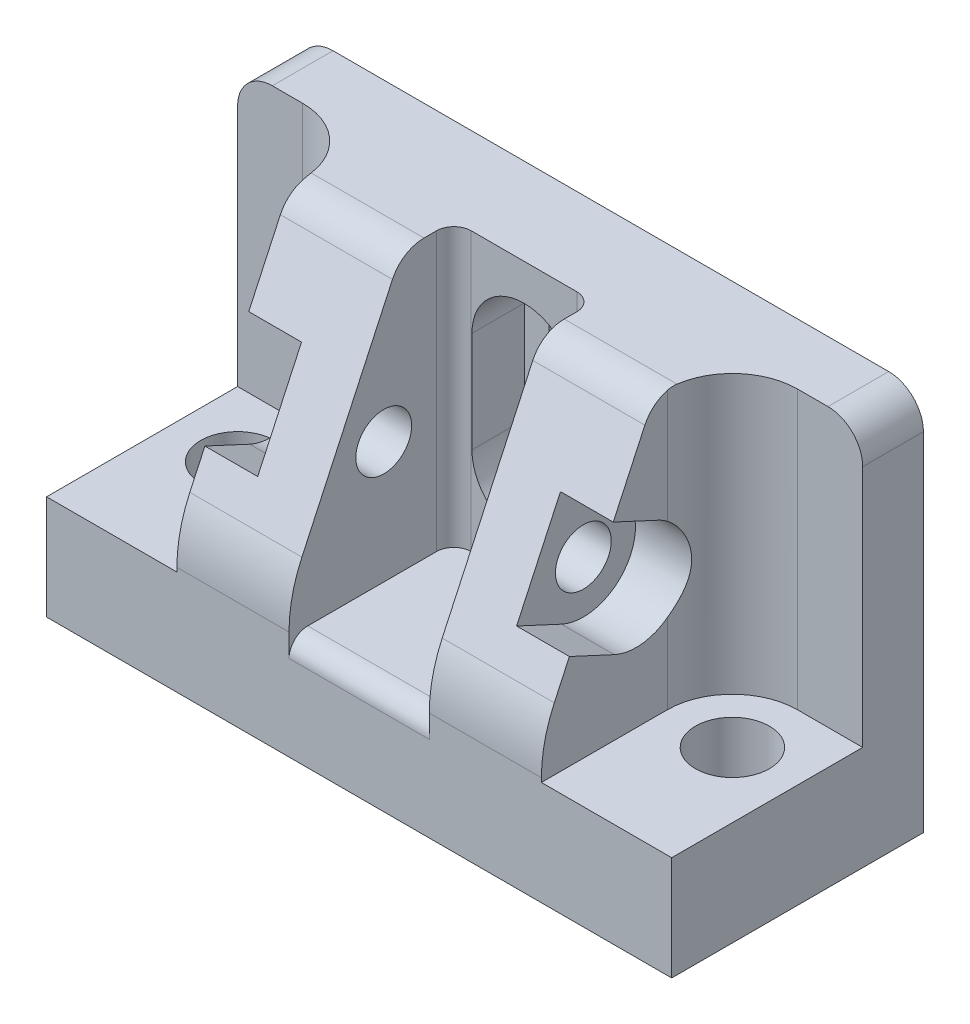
ISO-10303-21;
HEADER;
FILE_DESCRIPTION(('STEP AP214'),'2;1');
FILE_NAME('part.step','',(''),(''),'','','');
FILE_SCHEMA(('AUTOMOTIVE_DESIGN { 1 0 10303 214 1 1 1 1 }'));
ENDSEC;
DATA;
#1=APPLICATION_CONTEXT('core data for automotive mechanical design processes');
#2=APPLICATION_PROTOCOL_DEFINITION('international standard','automotive_design',2000,#1);
#3=PRODUCT_CONTEXT('',#1,'mechanical');
#4=PRODUCT('Part','Part','',(#3));
#5=PRODUCT_RELATED_PRODUCT_CATEGORY('part','',(#4));
#6=PRODUCT_DEFINITION_FORMATION('','',#4);
#7=PRODUCT_DEFINITION_CONTEXT('part definition',#1,'design');
#8=PRODUCT_DEFINITION('design','',#6,#7);
#9=PRODUCT_DEFINITION_SHAPE('','',#8);
#10=(LENGTH_UNIT() NAMED_UNIT(*) SI_UNIT(.MILLI.,.METRE.));
#11=(NAMED_UNIT(*) PLANE_ANGLE_UNIT() SI_UNIT($,.RADIAN.));
#12=(NAMED_UNIT(*) SI_UNIT($,.STERADIAN.) SOLID_ANGLE_UNIT());
#13=UNCERTAINTY_MEASURE_WITH_UNIT(LENGTH_MEASURE(1.E-05),#10,'distance_accuracy_value','');
#14=(GEOMETRIC_REPRESENTATION_CONTEXT(3) GLOBAL_UNCERTAINTY_ASSIGNED_CONTEXT((#13)) GLOBAL_UNIT_ASSIGNED_CONTEXT((#10,
#11,#12)) REPRESENTATION_CONTEXT('',''));
#15=CARTESIAN_POINT('',(0.,0.,0.));
#16=DIRECTION('',(0.,0.,1.));
#17=DIRECTION('',(1.,0.,0.));
#18=AXIS2_PLACEMENT_3D('',#15,#16,#17);
#19=CARTESIAN_POINT('',(0.,26.8404340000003,-15.0749));
#20=DIRECTION('',(0.,0.,1.));
#21=DIRECTION('',(1.,0.,0.));
#22=AXIS2_PLACEMENT_3D('',#19,#20,#21);
#23=CYLINDRICAL_SURFACE('',#22,2.5527);
#24=DIRECTION('',(0.,0.,1.));
#25=VECTOR('',#24,1.);
#26=CARTESIAN_POINT('',(2.5527,26.8404340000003,-23.0124));
#27=LINE('',#26,#25);
#28=CARTESIAN_POINT('',(2.5527,26.8404340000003,-23.0124));
#29=VERTEX_POINT('',#28);
#30=CARTESIAN_POINT('',(2.5527,26.8404340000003,-19.9009));
#31=VERTEX_POINT('',#30);
#32=EDGE_CURVE('E1321',#29,#31,#27,.T.);
#33=ORIENTED_EDGE('',*,*,#32,.T.);
#34=CARTESIAN_POINT('',(0.,26.8404340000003,-19.9009));
#35=DIRECTION('',(0.,0.,1.));
#36=DIRECTION('',(1.,0.,0.));
#37=AXIS2_PLACEMENT_3D('',#34,#35,#36);
#38=CIRCLE('',#37,2.5527);
#39=CARTESIAN_POINT('',(-2.5527,26.8404340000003,-19.9009));
#40=VERTEX_POINT('',#39);
#41=EDGE_CURVE('E343',#31,#40,#38,.T.);
#42=ORIENTED_EDGE('',*,*,#41,.T.);
#43=DIRECTION('',(0.,0.,1.));
#44=VECTOR('',#43,1.);
#45=CARTESIAN_POINT('',(-2.5527,26.8404340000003,-23.0124));
#46=LINE('',#45,#44);
#47=CARTESIAN_POINT('',(-2.5527,26.8404340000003,-23.0124));
#48=VERTEX_POINT('',#47);
#49=EDGE_CURVE('E327',#48,#40,#46,.T.);
#50=ORIENTED_EDGE('',*,*,#49,.F.);
#51=CARTESIAN_POINT('',(0.,26.8404340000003,-23.0124));
#52=DIRECTION('',(0.,0.,1.));
#53=DIRECTION('',(1.,0.,0.));
#54=AXIS2_PLACEMENT_3D('',#51,#52,#53);
#55=CIRCLE('',#54,2.5527);
#56=EDGE_CURVE('E341',#29,#48,#55,.T.);
#57=ORIENTED_EDGE('',*,*,#56,.F.);
#58=EDGE_LOOP('',(#33,#42,#50,#57));
#59=FACE_BOUND('',#58,.T.);
#60=ADVANCED_FACE('F37',(#59),#23,.F.);
#61=CARTESIAN_POINT('',(16.6624,20.6375000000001,-8.66139999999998));
#62=DIRECTION('',(1.,0.,0.));
#63=DIRECTION('',(0.,0.,-1.));
#64=AXIS2_PLACEMENT_3D('',#61,#62,#63);
#65=CYLINDRICAL_SURFACE('',#64,4.7625);
#66=CARTESIAN_POINT('',(16.6624,20.6375000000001,-8.66139999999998));
#67=DIRECTION('',(1.,0.,0.));
#68=DIRECTION('',(0.,0.,-1.));
#69=AXIS2_PLACEMENT_3D('',#66,#67,#68);
#70=CIRCLE('',#69,4.7625);
#71=CARTESIAN_POINT('',(16.6624,24.4569920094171,-11.5062));
#72=VERTEX_POINT('',#71);
#73=CARTESIAN_POINT('',(16.6624,24.9576015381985,-10.6659271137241));
#74=VERTEX_POINT('',#73);
#75=EDGE_CURVE('E692',#72,#74,#70,.T.);
#76=ORIENTED_EDGE('',*,*,#75,.T.);
#77=DIRECTION('',(1.,0.,0.));
#78=VECTOR('',#77,1.);
#79=CARTESIAN_POINT('',(16.6624,24.9576015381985,-10.6659271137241));
#80=LINE('',#79,#78);
#81=CARTESIAN_POINT('',(11.8364,24.9576015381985,-10.6659271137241));
#82=VERTEX_POINT('',#81);
#83=EDGE_CURVE('E722',#74,#82,#80,.F.);
#84=ORIENTED_EDGE('',*,*,#83,.T.);
#85=CARTESIAN_POINT('',(11.8364,20.6375000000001,-8.66139999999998));
#86=DIRECTION('',(1.,0.,0.));
#87=DIRECTION('',(0.,0.,-1.));
#88=AXIS2_PLACEMENT_3D('',#85,#86,#87);
#89=CIRCLE('',#88,4.7625);
#90=CARTESIAN_POINT('',(11.8364,16.3173984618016,-6.65687288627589));
#91=VERTEX_POINT('',#90);
#92=EDGE_CURVE('E694',#91,#82,#89,.T.);
#93=ORIENTED_EDGE('',*,*,#92,.F.);
#94=DIRECTION('',(1.,0.,0.));
#95=VECTOR('',#94,1.);
#96=CARTESIAN_POINT('',(16.6624,16.3173984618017,-6.65687288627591));
#97=LINE('',#96,#95);
#98=CARTESIAN_POINT('',(16.6624,16.3173984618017,-6.65687288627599));
#99=VERTEX_POINT('',#98);
#100=EDGE_CURVE('E719',#99,#91,#97,.F.);
#101=ORIENTED_EDGE('',*,*,#100,.F.);
#102=CARTESIAN_POINT('',(16.6624,16.8180079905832,-11.5062));
#103=VERTEX_POINT('',#102);
#104=EDGE_CURVE('E695',#99,#103,#70,.T.);
#105=ORIENTED_EDGE('',*,*,#104,.T.);
#106=CARTESIAN_POINT('',(16.6624,24.456992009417,-11.5062));
#107=CARTESIAN_POINT('',(16.6623932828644,24.3783745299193,-11.6117847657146));
#108=CARTESIAN_POINT('',(16.6652070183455,24.2953796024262,-11.7140490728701));
#109=CARTESIAN_POINT('',(16.6753664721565,24.1214009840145,-11.91117864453));
#110=CARTESIAN_POINT('',(16.6827089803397,24.0304229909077,-12.0060490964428));
#111=CARTESIAN_POINT('',(16.7008040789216,23.8412993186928,-12.187622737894));
#112=CARTESIAN_POINT('',(16.711550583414,23.7431666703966,-12.2743401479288));
#113=CARTESIAN_POINT('',(16.7353517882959,23.5402579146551,-12.4392960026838));
#114=CARTESIAN_POINT('',(16.7484068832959,23.4354806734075,-12.5175329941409));
#115=CARTESIAN_POINT('',(16.7757136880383,23.2201793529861,-12.6649185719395));
#116=CARTESIAN_POINT('',(16.7899629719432,23.1096670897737,-12.7340848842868));
#117=CARTESIAN_POINT('',(16.8186445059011,22.883364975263,-12.8631213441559));
#118=CARTESIAN_POINT('',(16.8330767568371,22.7675750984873,-12.9229914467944));
#119=CARTESIAN_POINT('',(16.861155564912,22.5313416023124,-13.0330998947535));
#120=CARTESIAN_POINT('',(16.8748017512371,22.4108958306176,-13.0833337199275));
#121=CARTESIAN_POINT('',(16.9004040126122,22.1661841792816,-13.1737761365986));
#122=CARTESIAN_POINT('',(16.9123608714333,22.0419201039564,-13.2139893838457));
#123=CARTESIAN_POINT('',(16.934143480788,21.7864989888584,-13.2851765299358));
#124=CARTESIAN_POINT('',(16.9438938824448,21.6552471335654,-13.3158343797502));
#125=CARTESIAN_POINT('',(16.9601156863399,21.3904150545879,-13.3659388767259));
#126=CARTESIAN_POINT('',(16.9665870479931,21.2568348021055,-13.3853853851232));
#127=CARTESIAN_POINT('',(16.9757981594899,20.9884351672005,-13.4128671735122));
#128=CARTESIAN_POINT('',(16.9785395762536,20.853616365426,-13.4209075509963));
#129=CARTESIAN_POINT('',(16.980103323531,20.5837639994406,-13.4255082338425));
#130=CARTESIAN_POINT('',(16.9789258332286,20.4487304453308,-13.4220690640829));
#131=CARTESIAN_POINT('',(16.9728941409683,20.1863986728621,-13.4042164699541));
#132=CARTESIAN_POINT('',(16.968230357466,20.0590569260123,-13.3903712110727));
#133=CARTESIAN_POINT('',(16.9557424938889,19.806010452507,-13.3524985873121));
#134=CARTESIAN_POINT('',(16.9479172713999,19.6803063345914,-13.3284675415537));
#135=CARTESIAN_POINT('',(16.929589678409,19.4313889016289,-13.2704166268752));
#136=CARTESIAN_POINT('',(16.9190866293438,19.3081762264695,-13.236394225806));
#137=CARTESIAN_POINT('',(16.8960591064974,19.0650357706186,-13.1586299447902));
#138=CARTESIAN_POINT('',(16.8835338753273,18.9451092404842,-13.1148844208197));
#139=CARTESIAN_POINT('',(16.8436163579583,18.5873746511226,-12.9678507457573));
#140=CARTESIAN_POINT('',(16.8142268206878,18.3557068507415,-12.8497210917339));
#141=CARTESIAN_POINT('',(16.7578754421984,17.9147313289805,-12.5773978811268));
#142=CARTESIAN_POINT('',(16.7309106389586,17.7053962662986,-12.4232491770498));
#143=CARTESIAN_POINT('',(16.6953083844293,17.3818135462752,-12.141439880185));
#144=CARTESIAN_POINT('',(16.6835578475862,17.2597352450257,-12.0230827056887));
#145=CARTESIAN_POINT('',(16.6670983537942,17.0286839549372,-11.7737665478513));
#146=CARTESIAN_POINT('',(16.662389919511,16.9197119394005,-11.6428066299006));
#147=CARTESIAN_POINT('',(16.6624,16.8180079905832,-11.5062));
#148=B_SPLINE_CURVE_WITH_KNOTS('',3,(#106,#107,#108,#109,#110,#111,#112,#113,#114,#115,#116,
#117,#118,#119,#120,#121,#122,#123,#124,#125,#126,#127,#128,#129,#130,#131,#132,#133,#134,#135,
#136,#137,#138,#139,#140,#141,#142,#143,#144,#145,#146,#147),.UNSPECIFIED.,.F.,.F.,(4,2,2,2,2,2,
2,2,2,2,2,2,2,2,2,2,2,2,2,2,4),(0.,0.394703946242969,0.789128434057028,1.18285168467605,
1.57664230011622,1.96965151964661,2.36266263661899,2.75585765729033,3.14886965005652,
3.55376221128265,3.95865978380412,4.36337634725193,4.7680744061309,5.15214954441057,
5.53636359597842,5.92067510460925,6.30513088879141,7.08655063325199,7.86700245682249,
8.37727940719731,8.88759422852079),.UNSPECIFIED.);
#149=EDGE_CURVE('E386',#72,#103,#148,.T.);
#150=ORIENTED_EDGE('',*,*,#149,.F.);
#151=EDGE_LOOP('',(#76,#84,#93,#101,#105,#150));
#152=FACE_BOUND('',#151,.T.);
#153=ADVANCED_FACE('F413',(#152),#65,.F.);
#154=CARTESIAN_POINT('',(-16.6624,34.925,-11.5062));
#155=DIRECTION('',(-1.,0.,0.));
#156=DIRECTION('',(0.,0.,1.));
#157=AXIS2_PLACEMENT_3D('',#154,#155,#156);
#158=PLANE('',#157);
#159=CARTESIAN_POINT('',(-16.6624,20.6375,-8.6614));
#160=DIRECTION('',(-1.,0.,0.));
#161=DIRECTION('',(0.,0.,1.));
#162=AXIS2_PLACEMENT_3D('',#159,#160,#161);
#163=CIRCLE('',#162,4.7625);
#164=CARTESIAN_POINT('',(-16.6624,24.9576015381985,-10.6659271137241));
#165=VERTEX_POINT('',#164);
#166=CARTESIAN_POINT('',(-16.6624,24.456992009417,-11.5062));
#167=VERTEX_POINT('',#166);
#168=EDGE_CURVE('E563',#165,#167,#163,.T.);
#169=ORIENTED_EDGE('',*,*,#168,.F.);
#170=DIRECTION('',(0.,0.420898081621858,0.907107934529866));
#171=VECTOR('',#170,1.);
#172=CARTESIAN_POINT('',(-16.6624,26.4025617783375,-7.55178866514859));
#173=LINE('',#172,#171);
#174=CARTESIAN_POINT('',(-16.6624,26.8583546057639,-6.56947653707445));
#175=VERTEX_POINT('',#174);
#176=EDGE_CURVE('E377',#165,#175,#173,.T.);
#177=ORIENTED_EDGE('',*,*,#176,.T.);
#178=DIRECTION('',(0.,0.907107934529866,-0.420898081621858));
#179=VECTOR('',#178,1.);
#180=CARTESIAN_POINT('',(-16.6624,12.7,0.));
#181=LINE('',#180,#179);
#182=CARTESIAN_POINT('',(-16.6624,33.0863514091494,-9.45926705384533));
#183=VERTEX_POINT('',#182);
#184=EDGE_CURVE('E672',#175,#183,#181,.T.);
#185=ORIENTED_EDGE('',*,*,#184,.T.);
#186=CARTESIAN_POINT('',(-16.6624,31.75,-12.3393347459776));
#187=DIRECTION('',(-1.,0.,0.));
#188=DIRECTION('',(0.,0.,1.));
#189=AXIS2_PLACEMENT_3D('',#186,#187,#188);
#190=CIRCLE('',#189,3.175);
#191=CARTESIAN_POINT('',(-16.6624,34.8137414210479,-11.5062));
#192=VERTEX_POINT('',#191);
#193=EDGE_CURVE('E675',#192,#183,#190,.F.);
#194=ORIENTED_EDGE('',*,*,#193,.F.);
#195=DIRECTION('',(0.,-1.,0.));
#196=VECTOR('',#195,1.);
#197=CARTESIAN_POINT('',(-16.6624,34.925,-11.5062));
#198=LINE('',#197,#196);
#199=EDGE_CURVE('E639',#192,#167,#198,.T.);
#200=ORIENTED_EDGE('',*,*,#199,.T.);
#201=EDGE_LOOP('',(#169,#177,#185,#194,#200));
#202=FACE_BOUND('',#201,.T.);
#203=ADVANCED_FACE('F416',(#202),#158,.T.);
#204=CARTESIAN_POINT('',(28.575,12.7,0.));
#205=DIRECTION('',(0.,-0.420898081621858,-0.907107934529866));
#206=DIRECTION('',(0.,0.907107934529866,-0.420898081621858));
#207=AXIS2_PLACEMENT_3D('',#204,#205,#206);
#208=PLANE('',#207);
#209=DIRECTION('',(1.,0.,0.));
#210=VECTOR('',#209,1.);
#211=CARTESIAN_POINT('',(28.575,18.2181515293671,-2.56042230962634));
#212=LINE('',#211,#210);
#213=CARTESIAN_POINT('',(-16.6624,18.2181515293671,-2.56042230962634));
#214=VERTEX_POINT('',#213);
#215=CARTESIAN_POINT('',(-11.8364,18.2181515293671,-2.56042230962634));
#216=VERTEX_POINT('',#215);
#217=EDGE_CURVE('E383',#214,#216,#212,.T.);
#218=ORIENTED_EDGE('',*,*,#217,.F.);
#219=CARTESIAN_POINT('',(-16.6624,15.242519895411,-1.1797292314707));
#220=VERTEX_POINT('',#219);
#221=EDGE_CURVE('E673',#220,#214,#181,.T.);
#222=ORIENTED_EDGE('',*,*,#221,.F.);
#223=DIRECTION('',(-1.,0.,0.));
#224=VECTOR('',#223,1.);
#225=CARTESIAN_POINT('',(28.575,15.242519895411,-1.1797292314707));
#226=LINE('',#225,#224);
#227=CARTESIAN_POINT('',(-6.4135,15.242519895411,-1.1797292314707));
#228=VERTEX_POINT('',#227);
#229=EDGE_CURVE('E804',#220,#228,#226,.F.);
#230=ORIENTED_EDGE('',*,*,#229,.T.);
#231=DIRECTION('',(0.,0.907107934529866,-0.420898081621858));
#232=VECTOR('',#231,1.);
#233=CARTESIAN_POINT('',(-6.4135,12.7,0.));
#234=LINE('',#233,#232);
#235=CARTESIAN_POINT('',(-6.4135,33.0863514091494,-9.45926705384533));
#236=VERTEX_POINT('',#235);
#237=EDGE_CURVE('E589',#228,#236,#234,.T.);
#238=ORIENTED_EDGE('',*,*,#237,.T.);
#239=DIRECTION('',(-1.,0.,0.));
#240=VECTOR('',#239,1.);
#241=CARTESIAN_POINT('',(28.575,33.0863514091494,-9.45926705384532));
#242=LINE('',#241,#240);
#243=EDGE_CURVE('E790',#236,#183,#242,.T.);
#244=ORIENTED_EDGE('',*,*,#243,.T.);
#245=ORIENTED_EDGE('',*,*,#184,.F.);
#246=DIRECTION('',(-1.,0.,0.));
#247=VECTOR('',#246,1.);
#248=CARTESIAN_POINT('',(28.575,26.8583546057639,-6.56947653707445));
#249=LINE('',#248,#247);
#250=CARTESIAN_POINT('',(-11.8364,26.8583546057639,-6.56947653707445));
#251=VERTEX_POINT('',#250);
#252=EDGE_CURVE('E375',#251,#175,#249,.T.);
#253=ORIENTED_EDGE('',*,*,#252,.F.);
#254=DIRECTION('',(0.,-0.907107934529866,0.420898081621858));
#255=VECTOR('',#254,1.);
#256=CARTESIAN_POINT('',(-11.8364,12.7,0.));
#257=LINE('',#256,#255);
#258=EDGE_CURVE('E708',#251,#216,#257,.T.);
#259=ORIENTED_EDGE('',*,*,#258,.T.);
#260=EDGE_LOOP('',(#218,#222,#230,#238,#244,#245,#253,#259));
#261=FACE_BOUND('',#260,.T.);
#262=ADVANCED_FACE('F465',(#261),#208,.F.);
#263=ORIENTED_EDGE('',*,*,#221,.T.);
#264=DIRECTION('',(0.,-0.420898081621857,-0.907107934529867));
#265=VECTOR('',#264,1.);
#266=CARTESIAN_POINT('',(-16.6624,17.7623587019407,-3.54273443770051));
#267=LINE('',#266,#265);
#268=CARTESIAN_POINT('',(-16.6624,16.3173984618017,-6.65687288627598));
#269=VERTEX_POINT('',#268);
#270=EDGE_CURVE('E380',#214,#269,#267,.T.);
#271=ORIENTED_EDGE('',*,*,#270,.T.);
#272=CARTESIAN_POINT('',(-16.6624,16.818007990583,-11.5062));
#273=VERTEX_POINT('',#272);
#274=EDGE_CURVE('E568',#273,#269,#163,.T.);
#275=ORIENTED_EDGE('',*,*,#274,.F.);
#276=CARTESIAN_POINT('',(-16.6624,9.525,-11.5062));
#277=VERTEX_POINT('',#276);
#278=EDGE_CURVE('E629',#273,#277,#198,.T.);
#279=ORIENTED_EDGE('',*,*,#278,.T.);
#280=DIRECTION('',(0.,0.,-1.));
#281=VECTOR('',#280,1.);
#282=CARTESIAN_POINT('',(-16.6624,9.525,-11.5062));
#283=LINE('',#282,#281);
#284=CARTESIAN_POINT('',(-16.6624,9.525,0.));
#285=VERTEX_POINT('',#284);
#286=EDGE_CURVE('E630',#285,#277,#283,.T.);
#287=ORIENTED_EDGE('',*,*,#286,.F.);
#288=DIRECTION('',(0.,-1.,0.));
#289=VECTOR('',#288,1.);
#290=CARTESIAN_POINT('',(-16.6624,34.925,0.));
#291=LINE('',#290,#289);
#292=CARTESIAN_POINT('',(-16.6624,9.89711425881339,0.));
#293=VERTEX_POINT('',#292);
#294=EDGE_CURVE('E642',#293,#285,#291,.T.);
#295=ORIENTED_EDGE('',*,*,#294,.F.);
#296=CARTESIAN_POINT('',(-16.6624,9.89711425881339,-12.7));
#297=DIRECTION('',(-1.,0.,0.));
#298=DIRECTION('',(0.,0.,1.));
#299=AXIS2_PLACEMENT_3D('',#296,#297,#298);
#300=CIRCLE('',#299,12.7);
#301=EDGE_CURVE('E714',#220,#293,#300,.F.);
#302=ORIENTED_EDGE('',*,*,#301,.F.);
#303=EDGE_LOOP('',(#263,#271,#275,#279,#287,#295,#302));
#304=FACE_BOUND('',#303,.T.);
#305=ADVANCED_FACE('F430',(#304),#158,.T.);
#306=CARTESIAN_POINT('',(-16.6624,20.6375,-8.6614));
#307=DIRECTION('',(-1.,0.,0.));
#308=DIRECTION('',(0.,0.,1.));
#309=AXIS2_PLACEMENT_3D('',#306,#307,#308);
#310=CYLINDRICAL_SURFACE('',#309,4.7625);
#311=ORIENTED_EDGE('',*,*,#274,.T.);
#312=DIRECTION('',(-1.,0.,0.));
#313=VECTOR('',#312,1.);
#314=CARTESIAN_POINT('',(-16.6624,16.3173984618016,-6.65687288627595));
#315=LINE('',#314,#313);
#316=CARTESIAN_POINT('',(-11.8364,16.3173984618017,-6.65687288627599));
#317=VERTEX_POINT('',#316);
#318=EDGE_CURVE('E554',#269,#317,#315,.F.);
#319=ORIENTED_EDGE('',*,*,#318,.T.);
#320=CARTESIAN_POINT('',(-11.8364,20.6375,-8.6614));
#321=DIRECTION('',(-1.,0.,0.));
#322=DIRECTION('',(0.,0.,1.));
#323=AXIS2_PLACEMENT_3D('',#320,#321,#322);
#324=CIRCLE('',#323,4.7625);
#325=CARTESIAN_POINT('',(-11.8364,24.9576015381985,-10.6659271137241));
#326=VERTEX_POINT('',#325);
#327=EDGE_CURVE('E559',#326,#317,#324,.T.);
#328=ORIENTED_EDGE('',*,*,#327,.F.);
#329=DIRECTION('',(-1.,0.,0.));
#330=VECTOR('',#329,1.);
#331=CARTESIAN_POINT('',(-16.6624,24.9576015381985,-10.6659271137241));
#332=LINE('',#331,#330);
#333=EDGE_CURVE('E550',#165,#326,#332,.F.);
#334=ORIENTED_EDGE('',*,*,#333,.F.);
#335=ORIENTED_EDGE('',*,*,#168,.T.);
#336=CARTESIAN_POINT('',(-16.6624,16.8180079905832,-11.5062));
#337=CARTESIAN_POINT('',(-16.6623932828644,16.8966254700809,-11.6117847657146));
#338=CARTESIAN_POINT('',(-16.6652070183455,16.979620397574,-11.7140490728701));
#339=CARTESIAN_POINT('',(-16.6753664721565,17.1535990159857,-11.91117864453));
#340=CARTESIAN_POINT('',(-16.6827089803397,17.2445770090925,-12.0060490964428));
#341=CARTESIAN_POINT('',(-16.7008040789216,17.4337006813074,-12.187622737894));
#342=CARTESIAN_POINT('',(-16.711550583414,17.5318333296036,-12.2743401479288));
#343=CARTESIAN_POINT('',(-16.7353517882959,17.7347420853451,-12.4392960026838));
#344=CARTESIAN_POINT('',(-16.7484068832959,17.8395193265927,-12.5175329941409));
#345=CARTESIAN_POINT('',(-16.7757136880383,18.0548206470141,-12.6649185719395));
#346=CARTESIAN_POINT('',(-16.7899629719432,18.1653329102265,-12.7340848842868));
#347=CARTESIAN_POINT('',(-16.8186445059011,18.3916350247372,-12.8631213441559));
#348=CARTESIAN_POINT('',(-16.8330767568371,18.507424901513,-12.9229914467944));
#349=CARTESIAN_POINT('',(-16.861155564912,18.7436583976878,-13.0330998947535));
#350=CARTESIAN_POINT('',(-16.8748017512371,18.8641041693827,-13.0833337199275));
#351=CARTESIAN_POINT('',(-16.9004040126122,19.1088158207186,-13.1737761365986));
#352=CARTESIAN_POINT('',(-16.9123608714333,19.2330798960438,-13.2139893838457));
#353=CARTESIAN_POINT('',(-16.934143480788,19.4885010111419,-13.2851765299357));
#354=CARTESIAN_POINT('',(-16.9438938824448,19.6197528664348,-13.3158343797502));
#355=CARTESIAN_POINT('',(-16.9601156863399,19.8845849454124,-13.3659388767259));
#356=CARTESIAN_POINT('',(-16.9665870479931,20.0181651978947,-13.3853853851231));
#357=CARTESIAN_POINT('',(-16.9757981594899,20.2865648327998,-13.4128671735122));
#358=CARTESIAN_POINT('',(-16.9785395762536,20.4213836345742,-13.4209075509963));
#359=CARTESIAN_POINT('',(-16.980103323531,20.6912360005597,-13.4255082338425));
#360=CARTESIAN_POINT('',(-16.9789258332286,20.8262695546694,-13.4220690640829));
#361=CARTESIAN_POINT('',(-16.9728941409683,21.0886013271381,-13.4042164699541));
#362=CARTESIAN_POINT('',(-16.968230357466,21.2159430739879,-13.3903712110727));
#363=CARTESIAN_POINT('',(-16.9557424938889,21.4689895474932,-13.3524985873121));
#364=CARTESIAN_POINT('',(-16.9479172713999,21.5946936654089,-13.3284675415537));
#365=CARTESIAN_POINT('',(-16.929589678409,21.8436110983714,-13.2704166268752));
#366=CARTESIAN_POINT('',(-16.9190866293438,21.9668237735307,-13.2363942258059));
#367=CARTESIAN_POINT('',(-16.8960591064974,22.2099642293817,-13.1586299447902));
#368=CARTESIAN_POINT('',(-16.8835338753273,22.329890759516,-13.1148844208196));
#369=CARTESIAN_POINT('',(-16.8436163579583,22.6876253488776,-12.9678507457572));
#370=CARTESIAN_POINT('',(-16.8142268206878,22.9192931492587,-12.8497210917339));
#371=CARTESIAN_POINT('',(-16.7578754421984,23.3602686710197,-12.5773978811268));
#372=CARTESIAN_POINT('',(-16.7309106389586,23.5696037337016,-12.4232491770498));
#373=CARTESIAN_POINT('',(-16.6953083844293,23.893186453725,-12.141439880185));
#374=CARTESIAN_POINT('',(-16.6835578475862,24.0152647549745,-12.0230827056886));
#375=CARTESIAN_POINT('',(-16.6670983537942,24.246316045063,-11.7737665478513));
#376=CARTESIAN_POINT('',(-16.662389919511,24.3552880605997,-11.6428066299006));
#377=CARTESIAN_POINT('',(-16.6624,24.456992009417,-11.5062));
#378=B_SPLINE_CURVE_WITH_KNOTS('',3,(#336,#337,#338,#339,#340,#341,#342,#343,#344,#345,#346,
#347,#348,#349,#350,#351,#352,#353,#354,#355,#356,#357,#358,#359,#360,#361,#362,#363,#364,#365,
#366,#367,#368,#369,#370,#371,#372,#373,#374,#375,#376,#377),.UNSPECIFIED.,.F.,.F.,(4,2,2,2,2,2,
2,2,2,2,2,2,2,2,2,2,2,2,2,2,4),(0.,0.394703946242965,0.789128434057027,1.18285168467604,
1.57664230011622,1.9696515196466,2.36266263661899,2.75585765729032,3.14886965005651,
3.55376221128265,3.95865978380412,4.36337634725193,4.7680744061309,5.15214954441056,
5.53636359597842,5.92067510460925,6.30513088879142,7.08655063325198,7.8670024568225,
8.37727940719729,8.88759422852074),.UNSPECIFIED.);
#379=EDGE_CURVE('E395',#273,#167,#378,.T.);
#380=ORIENTED_EDGE('',*,*,#379,.F.);
#381=EDGE_LOOP('',(#311,#319,#328,#334,#335,#380));
#382=FACE_BOUND('',#381,.T.);
#383=ADVANCED_FACE('F427',(#382),#310,.F.);
#384=CARTESIAN_POINT('',(22.6187,34.925,-11.5062));
#385=DIRECTION('',(0.,-1.,0.));
#386=DIRECTION('',(0.,0.,-1.));
#387=AXIS2_PLACEMENT_3D('',#384,#385,#386);
#388=CYLINDRICAL_SURFACE('',#387,5.95630000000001);
#389=DIRECTION('',(0.,-1.,0.));
#390=VECTOR('',#389,1.);
#391=CARTESIAN_POINT('',(16.6624,34.925,-11.5062));
#392=LINE('',#391,#390);
#393=CARTESIAN_POINT('',(16.6624,34.8137414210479,-11.5062));
#394=VERTEX_POINT('',#393);
#395=EDGE_CURVE('E635',#394,#72,#392,.T.);
#396=ORIENTED_EDGE('',*,*,#395,.T.);
#397=ORIENTED_EDGE('',*,*,#149,.T.);
#398=CARTESIAN_POINT('',(16.6624,9.525,-11.5062));
#399=VERTEX_POINT('',#398);
#400=EDGE_CURVE('E658',#103,#399,#392,.T.);
#401=ORIENTED_EDGE('',*,*,#400,.T.);
#402=CARTESIAN_POINT('',(22.6187,9.525,-11.5062));
#403=DIRECTION('',(0.,1.,0.));
#404=DIRECTION('',(0.,0.,-1.));
#405=AXIS2_PLACEMENT_3D('',#402,#403,#404);
#406=CIRCLE('',#405,5.95630000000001);
#407=CARTESIAN_POINT('',(22.6187,9.525,-17.4625));
#408=VERTEX_POINT('',#407);
#409=EDGE_CURVE('E617',#408,#399,#406,.T.);
#410=ORIENTED_EDGE('',*,*,#409,.F.);
#411=DIRECTION('',(0.,1.,0.));
#412=VECTOR('',#411,1.);
#413=CARTESIAN_POINT('',(22.6187,1.10151975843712,-17.4625));
#414=LINE('',#413,#412);
#415=CARTESIAN_POINT('',(22.6187,34.925,-17.4625));
#416=VERTEX_POINT('',#415);
#417=EDGE_CURVE('E609',#408,#416,#414,.T.);
#418=ORIENTED_EDGE('',*,*,#417,.T.);
#419=CARTESIAN_POINT('',(22.6187,34.925,-11.5062));
#420=DIRECTION('',(0.,1.,0.));
#421=DIRECTION('',(0.,0.,-1.));
#422=AXIS2_PLACEMENT_3D('',#419,#420,#421);
#423=CIRCLE('',#422,5.95630000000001);
#424=CARTESIAN_POINT('',(16.7209549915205,34.925,-12.3393347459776));
#425=VERTEX_POINT('',#424);
#426=EDGE_CURVE('E646',#416,#425,#423,.T.);
#427=ORIENTED_EDGE('',*,*,#426,.T.);
#428=CARTESIAN_POINT('',(17.1420973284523,31.75,-9.16433474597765));
#429=CARTESIAN_POINT('',(17.1420933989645,31.921493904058,-9.16433790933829));
#430=CARTESIAN_POINT('',(17.1360671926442,32.0930147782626,-9.17828741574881));
#431=CARTESIAN_POINT('',(17.1129683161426,32.430875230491,-9.23347300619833));
#432=CARTESIAN_POINT('',(17.0958892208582,32.5972117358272,-9.27472496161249));
#433=CARTESIAN_POINT('',(17.0534745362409,32.91960551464,-9.38273631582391));
#434=CARTESIAN_POINT('',(17.0281650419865,33.0756934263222,-9.44941521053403));
#435=CARTESIAN_POINT('',(16.9729305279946,33.374675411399,-9.60628142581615));
#436=CARTESIAN_POINT('',(16.9430040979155,33.5175654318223,-9.69647593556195));
#437=CARTESIAN_POINT('',(16.8809851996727,33.7942865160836,-9.90357542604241));
#438=CARTESIAN_POINT('',(16.8488614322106,33.9272497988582,-10.021632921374));
#439=CARTESIAN_POINT('',(16.7887301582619,34.1720979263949,-10.2788519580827));
#440=CARTESIAN_POINT('',(16.7607229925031,34.2839810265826,-10.418015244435));
#441=CARTESIAN_POINT('',(16.7131370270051,34.4844482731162,-10.7157768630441));
#442=CARTESIAN_POINT('',(16.6936489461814,34.5727779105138,-10.8745623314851));
#443=CARTESIAN_POINT('',(16.6676714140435,34.7212780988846,-11.2057586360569));
#444=CARTESIAN_POINT('',(16.661171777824,34.7814706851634,-11.3781586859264));
#445=CARTESIAN_POINT('',(16.6638985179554,34.8676314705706,-11.7158117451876));
#446=CARTESIAN_POINT('',(16.6718528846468,34.8960446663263,-11.8804532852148));
#447=CARTESIAN_POINT('',(16.7019047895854,34.9267315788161,-12.2108487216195));
#448=CARTESIAN_POINT('',(16.723999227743,34.92901102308,-12.3766023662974));
#449=CARTESIAN_POINT('',(16.7803722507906,34.9087367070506,-12.696413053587));
#450=CARTESIAN_POINT('',(16.8140370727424,34.8873317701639,-12.8506557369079));
#451=CARTESIAN_POINT('',(16.892105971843,34.8231605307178,-13.1517529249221));
#452=CARTESIAN_POINT('',(16.9365121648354,34.7803900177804,-13.2986059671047));
#453=CARTESIAN_POINT('',(17.0372973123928,34.6718590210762,-13.5921544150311));
#454=CARTESIAN_POINT('',(17.0942986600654,34.6046932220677,-13.7381123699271));
#455=CARTESIAN_POINT('',(17.2149855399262,34.4507129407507,-14.016262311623));
#456=CARTESIAN_POINT('',(17.27867575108,34.3638846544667,-14.1484445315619));
#457=CARTESIAN_POINT('',(17.4187365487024,34.1588669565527,-14.4154507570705));
#458=CARTESIAN_POINT('',(17.4956145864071,34.037964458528,-14.5479277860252));
#459=CARTESIAN_POINT('',(17.6480770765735,33.7751456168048,-14.7911688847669));
#460=CARTESIAN_POINT('',(17.7236610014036,33.6332209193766,-14.9019242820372));
#461=CARTESIAN_POINT('',(17.857456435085,33.3493573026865,-15.0866128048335));
#462=CARTESIAN_POINT('',(17.9166513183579,33.2097798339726,-15.1634524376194));
#463=CARTESIAN_POINT('',(18.0231918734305,32.9169488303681,-15.2964623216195));
#464=CARTESIAN_POINT('',(18.0705582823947,32.7637198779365,-15.3526688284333));
#465=CARTESIAN_POINT('',(18.1400560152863,32.475585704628,-15.4332300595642));
#466=CARTESIAN_POINT('',(18.1652359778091,32.3425411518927,-15.4615555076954));
#467=CARTESIAN_POINT('',(18.2004977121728,32.0719974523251,-15.5009121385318));
#468=CARTESIAN_POINT('',(18.2105960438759,31.9345033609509,-15.5119622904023));
#469=CARTESIAN_POINT('',(18.2142877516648,31.6587562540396,-15.5160223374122));
#470=CARTESIAN_POINT('',(18.2078500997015,31.5205022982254,-15.5089983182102));
#471=CARTESIAN_POINT('',(18.1793452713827,31.2476257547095,-15.4773540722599));
#472=CARTESIAN_POINT('',(18.1572613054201,31.1130072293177,-15.4527149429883));
#473=CARTESIAN_POINT('',(18.0943734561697,30.8236399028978,-15.380563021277));
#474=CARTESIAN_POINT('',(18.0506511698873,30.6704542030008,-15.3293848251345));
#475=CARTESIAN_POINT('',(17.9505990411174,30.3770076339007,-15.2065499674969));
#476=CARTESIAN_POINT('',(17.894252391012,30.2367643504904,-15.1348659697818));
#477=CARTESIAN_POINT('',(17.773527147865,29.9683219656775,-14.9720675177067));
#478=CARTESIAN_POINT('',(17.709031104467,29.8403604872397,-14.8806512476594));
#479=CARTESIAN_POINT('',(17.5775216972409,29.600022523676,-14.6808463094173));
#480=CARTESIAN_POINT('',(17.5105078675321,29.4876489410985,-14.5724544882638));
#481=CARTESIAN_POINT('',(17.3632797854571,29.2566340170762,-14.3141605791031));
#482=CARTESIAN_POINT('',(17.2833982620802,29.1420350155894,-14.1603698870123));
#483=CARTESIAN_POINT('',(17.1699934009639,28.9912957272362,-13.913969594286));
#484=CARTESIAN_POINT('',(17.1332360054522,28.9445485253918,-13.8291470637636));
#485=CARTESIAN_POINT('',(17.062572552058,28.8586261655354,-13.6546394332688));
#486=CARTESIAN_POINT('',(17.0286648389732,28.8194465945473,-13.5649572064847));
#487=CARTESIAN_POINT('',(16.9654541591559,28.7503732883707,-13.3842792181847));
#488=CARTESIAN_POINT('',(16.9360360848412,28.7202155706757,-13.2934247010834));
#489=CARTESIAN_POINT('',(16.8810992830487,28.6680298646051,-13.1083107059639));
#490=CARTESIAN_POINT('',(16.8555783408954,28.6459972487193,-13.0140531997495));
#491=CARTESIAN_POINT('',(16.8089393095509,28.6105467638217,-12.8229587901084));
#492=CARTESIAN_POINT('',(16.7878168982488,28.5971204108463,-12.7261245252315));
#493=CARTESIAN_POINT('',(16.7503314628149,28.5792565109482,-12.5307241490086));
#494=CARTESIAN_POINT('',(16.7339675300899,28.5748172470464,-12.4321583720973));
#495=CARTESIAN_POINT('',(16.7082989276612,28.5751662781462,-12.2490983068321));
#496=CARTESIAN_POINT('',(16.6983057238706,28.5786782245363,-12.1646956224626));
#497=CARTESIAN_POINT('',(16.6819732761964,28.5924778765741,-11.9960598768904));
#498=CARTESIAN_POINT('',(16.6756351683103,28.6027676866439,-11.911826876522));
#499=CARTESIAN_POINT('',(16.6665711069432,28.6301006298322,-11.7443161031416));
#500=CARTESIAN_POINT('',(16.6638429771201,28.647139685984,-11.661037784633));
#501=CARTESIAN_POINT('',(16.6618359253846,28.6878510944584,-11.496066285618));
#502=CARTESIAN_POINT('',(16.6625582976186,28.7115259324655,-11.4143737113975));
#503=CARTESIAN_POINT('',(16.6692617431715,28.7887043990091,-11.1832769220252));
#504=CARTESIAN_POINT('',(16.6792597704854,28.8502716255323,-11.0365862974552));
#505=CARTESIAN_POINT('',(16.7082776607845,28.9940868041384,-10.7548321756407));
#506=CARTESIAN_POINT('',(16.7272988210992,29.0763377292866,-10.6197703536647));
#507=CARTESIAN_POINT('',(16.7727670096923,29.2645757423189,-10.3566829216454));
#508=CARTESIAN_POINT('',(16.7995753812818,29.3716481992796,-10.2294966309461));
#509=CARTESIAN_POINT('',(16.8563712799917,29.6038907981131,-9.99364228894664));
#510=CARTESIAN_POINT('',(16.8863608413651,29.7290725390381,-9.88498620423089));
#511=CARTESIAN_POINT('',(16.9481037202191,30.0059396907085,-9.68021554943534));
#512=CARTESIAN_POINT('',(16.9797978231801,30.1589607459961,-9.58588100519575));
#513=CARTESIAN_POINT('',(17.0375112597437,30.479548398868,-9.42406992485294));
#514=CARTESIAN_POINT('',(17.0635340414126,30.6471060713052,-9.35657704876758));
#515=CARTESIAN_POINT('',(17.1028623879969,30.9695680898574,-9.25775812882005));
#516=CARTESIAN_POINT('',(17.1173932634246,31.1232228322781,-9.22283387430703));
#517=CARTESIAN_POINT('',(17.1370106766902,31.4345785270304,-9.17612529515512));
#518=CARTESIAN_POINT('',(17.142100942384,31.5922778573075,-9.16433183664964));
#519=CARTESIAN_POINT('',(17.1420973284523,31.75,-9.16433474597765));
#520=B_SPLINE_CURVE_WITH_KNOTS('',3,(#428,#429,#430,#431,#432,#433,#434,#435,#436,#437,#438,
#439,#440,#441,#442,#443,#444,#445,#446,#447,#448,#449,#450,#451,#452,#453,#454,#455,#456,#457,
#458,#459,#460,#461,#462,#463,#464,#465,#466,#467,#468,#469,#470,#471,#472,#473,#474,#475,#476,
#477,#478,#479,#480,#481,#482,#483,#484,#485,#486,#487,#488,#489,#490,#491,#492,#493,#494,#495,
#496,#497,#498,#499,#500,#501,#502,#503,#504,#505,#506,#507,#508,#509,#510,#511,#512,#513,#514,
#515,#516,#517,#518,#519),.UNSPECIFIED.,.T.,.F.,(4,2,2,2,2,2,2,2,2,2,2,2,2,2,2,2,2,2,2,2,2,2,2,
2,2,2,2,2,2,2,2,2,2,2,2,2,2,2,2,2,2,2,2,2,2,4),(0.,0.513879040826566,1.02805707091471,
1.54062050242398,2.0533408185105,2.59294367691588,3.13259117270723,3.67785307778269,
4.22268724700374,4.72187126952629,5.22094588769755,5.69683364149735,6.17281521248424,
6.6822721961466,7.19208795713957,7.77512210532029,8.35838856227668,8.86644793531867,
9.37361024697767,9.78686434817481,10.1996643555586,10.6132395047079,11.0272591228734,
11.526534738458,12.0264790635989,12.5346938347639,13.0430031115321,13.6629326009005,
13.9733668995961,14.2836196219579,14.5836239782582,14.8834572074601,15.1829944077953,
15.482474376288,15.7373318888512,15.992268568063,16.2470514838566,16.5019299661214,
16.9778300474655,17.4537985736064,17.9568854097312,18.460295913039,19.0053337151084,
19.550039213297,20.0228381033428,20.4954502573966),.UNSPECIFIED.);
#521=EDGE_CURVE('E482',#394,#425,#520,.T.);
#522=ORIENTED_EDGE('',*,*,#521,.F.);
#523=EDGE_LOOP('',(#396,#397,#401,#410,#418,#427,#522));
#524=FACE_BOUND('',#523,.T.);
#525=ADVANCED_FACE('F403',(#524),#388,.F.);
#526=CARTESIAN_POINT('',(-22.6187,34.925,-11.5062));
#527=DIRECTION('',(0.,-1.,0.));
#528=DIRECTION('',(0.,0.,-1.));
#529=AXIS2_PLACEMENT_3D('',#526,#527,#528);
#530=CYLINDRICAL_SURFACE('',#529,5.95630000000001);
#531=ORIENTED_EDGE('',*,*,#278,.F.);
#532=ORIENTED_EDGE('',*,*,#379,.T.);
#533=ORIENTED_EDGE('',*,*,#199,.F.);
#534=CARTESIAN_POINT('',(-17.1420973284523,31.75,-9.16433474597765));
#535=CARTESIAN_POINT('',(-17.1420933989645,31.578506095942,-9.16433790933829));
#536=CARTESIAN_POINT('',(-17.1360671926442,31.4069852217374,-9.17828741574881));
#537=CARTESIAN_POINT('',(-17.1129683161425,31.069124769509,-9.23347300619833));
#538=CARTESIAN_POINT('',(-17.0958892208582,30.9027882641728,-9.27472496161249));
#539=CARTESIAN_POINT('',(-17.0534745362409,30.58039448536,-9.38273631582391));
#540=CARTESIAN_POINT('',(-17.0281650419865,30.4243065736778,-9.44941521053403));
#541=CARTESIAN_POINT('',(-16.9729305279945,30.1253245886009,-9.60628142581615));
#542=CARTESIAN_POINT('',(-16.9430040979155,29.9824345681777,-9.69647593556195));
#543=CARTESIAN_POINT('',(-16.8809851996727,29.7057134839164,-9.90357542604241));
#544=CARTESIAN_POINT('',(-16.8488614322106,29.5727502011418,-10.021632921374));
#545=CARTESIAN_POINT('',(-16.7887301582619,29.3279020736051,-10.2788519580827));
#546=CARTESIAN_POINT('',(-16.7607229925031,29.2160189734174,-10.418015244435));
#547=CARTESIAN_POINT('',(-16.7131370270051,29.0155517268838,-10.7157768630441));
#548=CARTESIAN_POINT('',(-16.6936489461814,28.9272220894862,-10.8745623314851));
#549=CARTESIAN_POINT('',(-16.6676714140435,28.7787219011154,-11.2057586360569));
#550=CARTESIAN_POINT('',(-16.661171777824,28.7185293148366,-11.3781586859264));
#551=CARTESIAN_POINT('',(-16.6638985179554,28.6323685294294,-11.7158117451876));
#552=CARTESIAN_POINT('',(-16.6718528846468,28.6039553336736,-11.8804532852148));
#553=CARTESIAN_POINT('',(-16.7019047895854,28.5732684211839,-12.2108487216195));
#554=CARTESIAN_POINT('',(-16.723999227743,28.57098897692,-12.3766023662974));
#555=CARTESIAN_POINT('',(-16.7803722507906,28.5912632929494,-12.696413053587));
#556=CARTESIAN_POINT('',(-16.8140370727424,28.6126682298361,-12.8506557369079));
#557=CARTESIAN_POINT('',(-16.892105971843,28.6768394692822,-13.1517529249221));
#558=CARTESIAN_POINT('',(-16.9365121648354,28.7196099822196,-13.2986059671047));
#559=CARTESIAN_POINT('',(-17.0372973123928,28.8281409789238,-13.5921544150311));
#560=CARTESIAN_POINT('',(-17.0942986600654,28.8953067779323,-13.7381123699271));
#561=CARTESIAN_POINT('',(-17.2149855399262,29.0492870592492,-14.016262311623));
#562=CARTESIAN_POINT('',(-17.27867575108,29.1361153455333,-14.1484445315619));
#563=CARTESIAN_POINT('',(-17.4187365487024,29.3411330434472,-14.4154507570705));
#564=CARTESIAN_POINT('',(-17.4956145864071,29.462035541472,-14.5479277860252));
#565=CARTESIAN_POINT('',(-17.6480770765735,29.7248543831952,-14.7911688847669));
#566=CARTESIAN_POINT('',(-17.7236610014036,29.8667790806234,-14.9019242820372));
#567=CARTESIAN_POINT('',(-17.857456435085,30.1506426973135,-15.0866128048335));
#568=CARTESIAN_POINT('',(-17.9166513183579,30.2902201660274,-15.1634524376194));
#569=CARTESIAN_POINT('',(-18.0231918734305,30.5830511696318,-15.2964623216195));
#570=CARTESIAN_POINT('',(-18.0705582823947,30.7362801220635,-15.3526688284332));
#571=CARTESIAN_POINT('',(-18.1400560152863,31.024414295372,-15.4332300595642));
#572=CARTESIAN_POINT('',(-18.1652359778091,31.1574588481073,-15.4615555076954));
#573=CARTESIAN_POINT('',(-18.2004977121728,31.4280025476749,-15.5009121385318));
#574=CARTESIAN_POINT('',(-18.2105960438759,31.5654966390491,-15.5119622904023));
#575=CARTESIAN_POINT('',(-18.2142877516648,31.8412437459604,-15.5160223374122));
#576=CARTESIAN_POINT('',(-18.2078500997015,31.9794977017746,-15.5089983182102));
#577=CARTESIAN_POINT('',(-18.1793452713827,32.2523742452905,-15.4773540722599));
#578=CARTESIAN_POINT('',(-18.1572613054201,32.3869927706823,-15.4527149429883));
#579=CARTESIAN_POINT('',(-18.0943734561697,32.6763600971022,-15.380563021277));
#580=CARTESIAN_POINT('',(-18.0506511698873,32.8295457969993,-15.3293848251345));
#581=CARTESIAN_POINT('',(-17.9505990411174,33.1229923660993,-15.2065499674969));
#582=CARTESIAN_POINT('',(-17.894252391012,33.2632356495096,-15.1348659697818));
#583=CARTESIAN_POINT('',(-17.773527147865,33.5316780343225,-14.9720675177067));
#584=CARTESIAN_POINT('',(-17.709031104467,33.6596395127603,-14.8806512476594));
#585=CARTESIAN_POINT('',(-17.5775216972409,33.899977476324,-14.6808463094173));
#586=CARTESIAN_POINT('',(-17.5105078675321,34.0123510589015,-14.5724544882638));
#587=CARTESIAN_POINT('',(-17.3632797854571,34.2433659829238,-14.314160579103));
#588=CARTESIAN_POINT('',(-17.2833982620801,34.3579649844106,-14.1603698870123));
#589=CARTESIAN_POINT('',(-17.1699934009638,34.5087042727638,-13.913969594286));
#590=CARTESIAN_POINT('',(-17.1332360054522,34.5554514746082,-13.8291470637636));
#591=CARTESIAN_POINT('',(-17.062572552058,34.6413738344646,-13.6546394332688));
#592=CARTESIAN_POINT('',(-17.0286648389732,34.6805534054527,-13.5649572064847));
#593=CARTESIAN_POINT('',(-16.9654541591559,34.7496267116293,-13.3842792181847));
#594=CARTESIAN_POINT('',(-16.9360360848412,34.7797844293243,-13.2934247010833));
#595=CARTESIAN_POINT('',(-16.8810992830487,34.8319701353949,-13.1083107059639));
#596=CARTESIAN_POINT('',(-16.8555783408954,34.8540027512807,-13.0140531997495));
#597=CARTESIAN_POINT('',(-16.8089393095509,34.8894532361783,-12.8229587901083));
#598=CARTESIAN_POINT('',(-16.7878168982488,34.9028795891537,-12.7261245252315));
#599=CARTESIAN_POINT('',(-16.7503314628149,34.9207434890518,-12.5307241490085));
#600=CARTESIAN_POINT('',(-16.7339675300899,34.9251827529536,-12.4321583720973));
#601=CARTESIAN_POINT('',(-16.7082989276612,34.9248337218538,-12.2490983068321));
#602=CARTESIAN_POINT('',(-16.6983057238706,34.9213217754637,-12.1646956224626));
#603=CARTESIAN_POINT('',(-16.6819732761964,34.9075221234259,-11.9960598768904));
#604=CARTESIAN_POINT('',(-16.6756351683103,34.8972323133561,-11.911826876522));
#605=CARTESIAN_POINT('',(-16.6665711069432,34.8698993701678,-11.7443161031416));
#606=CARTESIAN_POINT('',(-16.6638429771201,34.852860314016,-11.661037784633));
#607=CARTESIAN_POINT('',(-16.6618359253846,34.8121489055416,-11.496066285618));
#608=CARTESIAN_POINT('',(-16.6625582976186,34.7884740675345,-11.4143737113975));
#609=CARTESIAN_POINT('',(-16.6692617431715,34.7112956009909,-11.1832769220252));
#610=CARTESIAN_POINT('',(-16.6792597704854,34.6497283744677,-11.0365862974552));
#611=CARTESIAN_POINT('',(-16.7082776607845,34.5059131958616,-10.7548321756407));
#612=CARTESIAN_POINT('',(-16.7272988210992,34.4236622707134,-10.6197703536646));
#613=CARTESIAN_POINT('',(-16.7727670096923,34.2354242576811,-10.3566829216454));
#614=CARTESIAN_POINT('',(-16.7995753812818,34.1283518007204,-10.2294966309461));
#615=CARTESIAN_POINT('',(-16.8563712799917,33.8961092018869,-9.99364228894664));
#616=CARTESIAN_POINT('',(-16.8863608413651,33.7709274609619,-9.88498620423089));
#617=CARTESIAN_POINT('',(-16.9481037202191,33.4940603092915,-9.68021554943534));
#618=CARTESIAN_POINT('',(-16.9797978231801,33.3410392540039,-9.58588100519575));
#619=CARTESIAN_POINT('',(-17.0375112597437,33.020451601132,-9.42406992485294));
#620=CARTESIAN_POINT('',(-17.0635340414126,32.8528939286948,-9.35657704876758));
#621=CARTESIAN_POINT('',(-17.1028623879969,32.5304319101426,-9.25775812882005));
#622=CARTESIAN_POINT('',(-17.1173932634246,32.3767771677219,-9.22283387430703));
#623=CARTESIAN_POINT('',(-17.1370106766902,32.0654214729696,-9.17612529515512));
#624=CARTESIAN_POINT('',(-17.142100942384,31.9077221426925,-9.16433183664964));
#625=CARTESIAN_POINT('',(-17.1420973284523,31.75,-9.16433474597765));
#626=B_SPLINE_CURVE_WITH_KNOTS('',3,(#534,#535,#536,#537,#538,#539,#540,#541,#542,#543,#544,
#545,#546,#547,#548,#549,#550,#551,#552,#553,#554,#555,#556,#557,#558,#559,#560,#561,#562,#563,
#564,#565,#566,#567,#568,#569,#570,#571,#572,#573,#574,#575,#576,#577,#578,#579,#580,#581,#582,
#583,#584,#585,#586,#587,#588,#589,#590,#591,#592,#593,#594,#595,#596,#597,#598,#599,#600,#601,
#602,#603,#604,#605,#606,#607,#608,#609,#610,#611,#612,#613,#614,#615,#616,#617,#618,#619,#620,
#621,#622,#623,#624,#625),.UNSPECIFIED.,.T.,.F.,(4,2,2,2,2,2,2,2,2,2,2,2,2,2,2,2,2,2,2,2,2,2,2,
2,2,2,2,2,2,2,2,2,2,2,2,2,2,2,2,2,2,2,2,2,2,4),(0.,0.51387904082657,1.02805707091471,
1.54062050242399,2.0533408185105,2.59294367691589,3.13259117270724,3.6778530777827,
4.22268724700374,4.72187126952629,5.22094588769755,5.69683364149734,6.17281521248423,
6.68227219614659,7.19208795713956,7.77512210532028,8.35838856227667,8.86644793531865,
9.37361024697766,9.78686434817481,10.1996643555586,10.6132395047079,11.0272591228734,
11.526534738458,12.0264790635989,12.5346938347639,13.0430031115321,13.6629326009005,
13.9733668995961,14.2836196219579,14.5836239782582,14.8834572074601,15.1829944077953,
15.482474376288,15.7373318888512,15.992268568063,16.2470514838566,16.5019299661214,
16.9778300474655,17.4537985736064,17.9568854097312,18.460295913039,19.0053337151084,
19.550039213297,20.0228381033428,20.4954502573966),.UNSPECIFIED.);
#627=CARTESIAN_POINT('',(-16.7209549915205,34.925,-12.3393347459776));
#628=VERTEX_POINT('',#627);
#629=EDGE_CURVE('E473',#628,#192,#626,.T.);
#630=ORIENTED_EDGE('',*,*,#629,.F.);
#631=CARTESIAN_POINT('',(-22.6187,34.925,-11.5062));
#632=DIRECTION('',(0.,1.,0.));
#633=DIRECTION('',(0.,0.,1.));
#634=AXIS2_PLACEMENT_3D('',#631,#632,#633);
#635=CIRCLE('',#634,5.95630000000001);
#636=CARTESIAN_POINT('',(-22.6187,34.925,-17.4625));
#637=VERTEX_POINT('',#636);
#638=EDGE_CURVE('E626',#628,#637,#635,.T.);
#639=ORIENTED_EDGE('',*,*,#638,.T.);
#640=DIRECTION('',(0.,1.,0.));
#641=VECTOR('',#640,1.);
#642=CARTESIAN_POINT('',(-22.6187,1.10151975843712,-17.4625));
#643=LINE('',#642,#641);
#644=CARTESIAN_POINT('',(-22.6187,9.525,-17.4625));
#645=VERTEX_POINT('',#644);
#646=EDGE_CURVE('E615',#645,#637,#643,.T.);
#647=ORIENTED_EDGE('',*,*,#646,.F.);
#648=CARTESIAN_POINT('',(-22.6187,9.525,-11.5062));
#649=DIRECTION('',(0.,1.,0.));
#650=DIRECTION('',(0.,0.,1.));
#651=AXIS2_PLACEMENT_3D('',#648,#649,#650);
#652=CIRCLE('',#651,5.95630000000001);
#653=EDGE_CURVE('E631',#277,#645,#652,.T.);
#654=ORIENTED_EDGE('',*,*,#653,.F.);
#655=EDGE_LOOP('',(#531,#532,#533,#630,#639,#647,#654));
#656=FACE_BOUND('',#655,.T.);
#657=ADVANCED_FACE('F467',(#656),#530,.F.);
#658=CARTESIAN_POINT('',(16.6624,34.925,-11.5062));
#659=DIRECTION('',(1.,0.,0.));
#660=DIRECTION('',(0.,0.,-1.));
#661=AXIS2_PLACEMENT_3D('',#658,#659,#660);
#662=PLANE('',#661);
#663=DIRECTION('',(0.,0.420898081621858,0.907107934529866));
#664=VECTOR('',#663,1.);
#665=CARTESIAN_POINT('',(16.6624,26.4025617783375,-7.55178866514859));
#666=LINE('',#665,#664);
#667=CARTESIAN_POINT('',(16.6624,26.8583546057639,-6.56947653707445));
#668=VERTEX_POINT('',#667);
#669=EDGE_CURVE('E368',#74,#668,#666,.T.);
#670=ORIENTED_EDGE('',*,*,#669,.F.);
#671=ORIENTED_EDGE('',*,*,#75,.F.);
#672=ORIENTED_EDGE('',*,*,#395,.F.);
#673=CARTESIAN_POINT('',(16.6624,31.75,-12.3393347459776));
#674=DIRECTION('',(1.,0.,0.));
#675=DIRECTION('',(0.,0.,-1.));
#676=AXIS2_PLACEMENT_3D('',#673,#674,#675);
#677=CIRCLE('',#676,3.175);
#678=CARTESIAN_POINT('',(16.6624,33.0863514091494,-9.45926705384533));
#679=VERTEX_POINT('',#678);
#680=EDGE_CURVE('E669',#679,#394,#677,.F.);
#681=ORIENTED_EDGE('',*,*,#680,.F.);
#682=DIRECTION('',(0.,-0.907107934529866,0.420898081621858));
#683=VECTOR('',#682,1.);
#684=CARTESIAN_POINT('',(16.6624,12.7,0.));
#685=LINE('',#684,#683);
#686=EDGE_CURVE('E666',#679,#668,#685,.T.);
#687=ORIENTED_EDGE('',*,*,#686,.T.);
#688=EDGE_LOOP('',(#670,#671,#672,#681,#687));
#689=FACE_BOUND('',#688,.T.);
#690=ADVANCED_FACE('F444',(#689),#662,.T.);
#691=CARTESIAN_POINT('',(-6.4135,-42.1708163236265,-15.0749));
#692=DIRECTION('',(-1.,0.,0.));
#693=DIRECTION('',(0.,0.,1.));
#694=AXIS2_PLACEMENT_3D('',#691,#692,#693);
#695=PLANE('',#694);
#696=DIRECTION('',(0.,0.,1.));
#697=VECTOR('',#696,1.);
#698=CARTESIAN_POINT('',(-6.4135,9.525,-15.0749));
#699=LINE('',#698,#697);
#700=CARTESIAN_POINT('',(-6.4135,9.525,-13.4874));
#701=VERTEX_POINT('',#700);
#702=CARTESIAN_POINT('',(-6.4135,9.525,-1.7145));
#703=VERTEX_POINT('',#702);
#704=EDGE_CURVE('E578',#701,#703,#699,.T.);
#705=ORIENTED_EDGE('',*,*,#704,.F.);
#706=DIRECTION('',(0.,1.,0.));
#707=VECTOR('',#706,1.);
#708=CARTESIAN_POINT('',(-6.4135,34.925,-13.4874));
#709=LINE('',#708,#707);
#710=CARTESIAN_POINT('',(-6.4135,34.925,-13.4874));
#711=VERTEX_POINT('',#710);
#712=EDGE_CURVE('E724',#701,#711,#709,.T.);
#713=ORIENTED_EDGE('',*,*,#712,.T.);
#714=DIRECTION('',(0.,0.,1.));
#715=VECTOR('',#714,1.);
#716=CARTESIAN_POINT('',(-6.4135,34.925,-15.0749));
#717=LINE('',#716,#715);
#718=CARTESIAN_POINT('',(-6.4135,34.925,-12.3393347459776));
#719=VERTEX_POINT('',#718);
#720=EDGE_CURVE('E576',#711,#719,#717,.T.);
#721=ORIENTED_EDGE('',*,*,#720,.T.);
#722=CARTESIAN_POINT('',(-6.4135,31.75,-12.3393347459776));
#723=DIRECTION('',(-1.,0.,0.));
#724=DIRECTION('',(0.,0.,1.));
#725=AXIS2_PLACEMENT_3D('',#722,#723,#724);
#726=CIRCLE('',#725,3.175);
#727=EDGE_CURVE('E592',#719,#236,#726,.F.);
#728=ORIENTED_EDGE('',*,*,#727,.T.);
#729=ORIENTED_EDGE('',*,*,#237,.F.);
#730=CARTESIAN_POINT('',(-6.4135,9.89711425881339,-12.7));
#731=DIRECTION('',(-1.,0.,0.));
#732=DIRECTION('',(0.,0.,1.));
#733=AXIS2_PLACEMENT_3D('',#730,#731,#732);
#734=CIRCLE('',#733,12.7);
#735=CARTESIAN_POINT('',(-6.4135,9.89711425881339,0.));
#736=VERTEX_POINT('',#735);
#737=EDGE_CURVE('E580',#228,#736,#734,.F.);
#738=ORIENTED_EDGE('',*,*,#737,.T.);
#739=DIRECTION('',(0.,1.,0.));
#740=VECTOR('',#739,1.);
#741=CARTESIAN_POINT('',(-6.4135,0.,0.));
#742=LINE('',#741,#740);
#743=CARTESIAN_POINT('',(-6.4135,7.8105,0.));
#744=VERTEX_POINT('',#743);
#745=EDGE_CURVE('E586',#744,#736,#742,.T.);
#746=ORIENTED_EDGE('',*,*,#745,.F.);
#747=CARTESIAN_POINT('',(-6.4135,7.8105,-1.7145));
#748=DIRECTION('',(-1.,0.,0.));
#749=DIRECTION('',(0.,0.,1.));
#750=AXIS2_PLACEMENT_3D('',#747,#748,#749);
#751=CIRCLE('',#750,1.7145);
#752=EDGE_CURVE('E45',#744,#703,#751,.T.);
#753=ORIENTED_EDGE('',*,*,#752,.T.);
#754=EDGE_LOOP('',(#705,#713,#721,#728,#729,#738,#746,#753));
#755=FACE_BOUND('',#754,.T.);
#756=CARTESIAN_POINT('',(-6.4135,20.6375,-8.6614));
#757=DIRECTION('',(-1.,0.,0.));
#758=DIRECTION('',(0.,0.,1.));
#759=AXIS2_PLACEMENT_3D('',#756,#757,#758);
#760=CIRCLE('',#759,2.5527);
#761=CARTESIAN_POINT('',(-6.4135,20.6375,-6.1087));
#762=VERTEX_POINT('',#761);
#763=EDGE_CURVE('E566',#762,#762,#760,.F.);
#764=ORIENTED_EDGE('',*,*,#763,.F.);
#765=EDGE_LOOP('',(#764));
#766=FACE_BOUND('',#765,.T.);
#767=ADVANCED_FACE('F440',(#755,#766),#695,.F.);
#768=CARTESIAN_POINT('',(28.575,31.75,-12.3393347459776));
#769=DIRECTION('',(-1.,0.,0.));
#770=DIRECTION('',(0.,0.,1.));
#771=AXIS2_PLACEMENT_3D('',#768,#769,#770);
#772=CYLINDRICAL_SURFACE('',#771,3.175);
#773=CARTESIAN_POINT('',(6.4135,31.75,-12.3393347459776));
#774=DIRECTION('',(1.,0.,0.));
#775=DIRECTION('',(0.,0.,-1.));
#776=AXIS2_PLACEMENT_3D('',#773,#774,#775);
#777=CIRCLE('',#776,3.175);
#778=CARTESIAN_POINT('',(6.4135,33.0863514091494,-9.45926705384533));
#779=VERTEX_POINT('',#778);
#780=CARTESIAN_POINT('',(6.4135,34.925,-12.3393347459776));
#781=VERTEX_POINT('',#780);
#782=EDGE_CURVE('E601',#779,#781,#777,.F.);
#783=ORIENTED_EDGE('',*,*,#782,.F.);
#784=EDGE_CURVE('E784',#679,#779,#242,.T.);
#785=ORIENTED_EDGE('',*,*,#784,.F.);
#786=ORIENTED_EDGE('',*,*,#680,.T.);
#787=ORIENTED_EDGE('',*,*,#521,.T.);
#788=DIRECTION('',(-1.,0.,0.));
#789=VECTOR('',#788,1.);
#790=CARTESIAN_POINT('',(28.575,34.925,-12.3393347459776));
#791=LINE('',#790,#789);
#792=EDGE_CURVE('E682',#781,#425,#791,.F.);
#793=ORIENTED_EDGE('',*,*,#792,.F.);
#794=EDGE_LOOP('',(#783,#785,#786,#787,#793));
#795=FACE_BOUND('',#794,.T.);
#796=ADVANCED_FACE('F443',(#795),#772,.T.);
#797=CARTESIAN_POINT('',(16.6624,18.2181515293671,-2.56042230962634));
#798=VERTEX_POINT('',#797);
#799=CARTESIAN_POINT('',(16.6624,15.242519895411,-1.1797292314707));
#800=VERTEX_POINT('',#799);
#801=EDGE_CURVE('E665',#798,#800,#685,.T.);
#802=ORIENTED_EDGE('',*,*,#801,.F.);
#803=DIRECTION('',(-1.,0.,0.));
#804=VECTOR('',#803,1.);
#805=CARTESIAN_POINT('',(28.575,18.2181515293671,-2.56042230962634));
#806=LINE('',#805,#804);
#807=CARTESIAN_POINT('',(11.8364,18.2181515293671,-2.56042230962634));
#808=VERTEX_POINT('',#807);
#809=EDGE_CURVE('E362',#798,#808,#806,.T.);
#810=ORIENTED_EDGE('',*,*,#809,.T.);
#811=DIRECTION('',(0.,0.907107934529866,-0.420898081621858));
#812=VECTOR('',#811,1.);
#813=CARTESIAN_POINT('',(11.8364,12.7,0.));
#814=LINE('',#813,#812);
#815=CARTESIAN_POINT('',(11.8364,26.8583546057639,-6.56947653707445));
#816=VERTEX_POINT('',#815);
#817=EDGE_CURVE('E555',#808,#816,#814,.T.);
#818=ORIENTED_EDGE('',*,*,#817,.T.);
#819=DIRECTION('',(1.,0.,0.));
#820=VECTOR('',#819,1.);
#821=CARTESIAN_POINT('',(28.575,26.8583546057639,-6.56947653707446));
#822=LINE('',#821,#820);
#823=EDGE_CURVE('E365',#816,#668,#822,.T.);
#824=ORIENTED_EDGE('',*,*,#823,.T.);
#825=ORIENTED_EDGE('',*,*,#686,.F.);
#826=ORIENTED_EDGE('',*,*,#784,.T.);
#827=DIRECTION('',(0.,-0.907107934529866,0.420898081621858));
#828=VECTOR('',#827,1.);
#829=CARTESIAN_POINT('',(6.4135,12.7,0.));
#830=LINE('',#829,#828);
#831=CARTESIAN_POINT('',(6.4135,15.242519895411,-1.1797292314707));
#832=VERTEX_POINT('',#831);
#833=EDGE_CURVE('E598',#779,#832,#830,.T.);
#834=ORIENTED_EDGE('',*,*,#833,.T.);
#835=EDGE_CURVE('E803',#832,#800,#226,.F.);
#836=ORIENTED_EDGE('',*,*,#835,.T.);
#837=EDGE_LOOP('',(#802,#810,#818,#824,#825,#826,#834,#836));
#838=FACE_BOUND('',#837,.T.);
#839=ADVANCED_FACE('F787',(#838),#208,.F.);
#840=CARTESIAN_POINT('',(28.575,9.89711425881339,-12.7));
#841=DIRECTION('',(-1.,0.,0.));
#842=DIRECTION('',(0.,0.,1.));
#843=AXIS2_PLACEMENT_3D('',#840,#841,#842);
#844=CYLINDRICAL_SURFACE('',#843,12.7);
#845=CARTESIAN_POINT('',(6.4135,9.89711425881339,-12.7));
#846=DIRECTION('',(1.,0.,0.));
#847=DIRECTION('',(0.,0.,-1.));
#848=AXIS2_PLACEMENT_3D('',#845,#846,#847);
#849=CIRCLE('',#848,12.7);
#850=CARTESIAN_POINT('',(6.4135,9.89711425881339,0.));
#851=VERTEX_POINT('',#850);
#852=EDGE_CURVE('E594',#851,#832,#849,.F.);
#853=ORIENTED_EDGE('',*,*,#852,.F.);
#854=DIRECTION('',(-1.,0.,0.));
#855=VECTOR('',#854,1.);
#856=CARTESIAN_POINT('',(28.575,9.89711425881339,0.));
#857=LINE('',#856,#855);
#858=CARTESIAN_POINT('',(16.6624,9.89711425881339,0.));
#859=VERTEX_POINT('',#858);
#860=EDGE_CURVE('E801',#859,#851,#857,.T.);
#861=ORIENTED_EDGE('',*,*,#860,.F.);
#862=CARTESIAN_POINT('',(16.6624,9.89711425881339,-12.7));
#863=DIRECTION('',(1.,0.,0.));
#864=DIRECTION('',(0.,0.,-1.));
#865=AXIS2_PLACEMENT_3D('',#862,#863,#864);
#866=CIRCLE('',#865,12.7);
#867=EDGE_CURVE('E807',#859,#800,#866,.F.);
#868=ORIENTED_EDGE('',*,*,#867,.T.);
#869=ORIENTED_EDGE('',*,*,#835,.F.);
#870=EDGE_LOOP('',(#853,#861,#868,#869));
#871=FACE_BOUND('',#870,.T.);
#872=ADVANCED_FACE('F494',(#871),#844,.T.);
#873=ORIENTED_EDGE('',*,*,#727,.F.);
#874=EDGE_CURVE('E792',#628,#719,#791,.F.);
#875=ORIENTED_EDGE('',*,*,#874,.F.);
#876=ORIENTED_EDGE('',*,*,#629,.T.);
#877=ORIENTED_EDGE('',*,*,#193,.T.);
#878=ORIENTED_EDGE('',*,*,#243,.F.);
#879=EDGE_LOOP('',(#873,#875,#876,#877,#878));
#880=FACE_BOUND('',#879,.T.);
#881=ADVANCED_FACE('F488',(#880),#772,.T.);
#882=CARTESIAN_POINT('',(28.575,0.,0.));
#883=DIRECTION('',(0.,0.,-1.));
#884=DIRECTION('',(-1.,0.,0.));
#885=AXIS2_PLACEMENT_3D('',#882,#883,#884);
#886=PLANE('',#885);
#887=DIRECTION('',(-1.,0.,0.));
#888=VECTOR('',#887,1.);
#889=CARTESIAN_POINT('',(28.575,7.8105,0.));
#890=LINE('',#889,#888);
#891=CARTESIAN_POINT('',(6.4135,7.8105,0.));
#892=VERTEX_POINT('',#891);
#893=EDGE_CURVE('E761',#892,#744,#890,.T.);
#894=ORIENTED_EDGE('',*,*,#893,.T.);
#895=ORIENTED_EDGE('',*,*,#745,.T.);
#896=EDGE_CURVE('E800',#736,#293,#857,.T.);
#897=ORIENTED_EDGE('',*,*,#896,.T.);
#898=ORIENTED_EDGE('',*,*,#294,.T.);
#899=DIRECTION('',(1.,0.,0.));
#900=VECTOR('',#899,1.);
#901=CARTESIAN_POINT('',(28.575,9.525,0.));
#902=LINE('',#901,#900);
#903=CARTESIAN_POINT('',(-28.575,9.525,0.));
#904=VERTEX_POINT('',#903);
#905=EDGE_CURVE('E645',#904,#285,#902,.T.);
#906=ORIENTED_EDGE('',*,*,#905,.F.);
#907=DIRECTION('',(0.,-1.,0.));
#908=VECTOR('',#907,1.);
#909=CARTESIAN_POINT('',(-28.575,0.,0.));
#910=LINE('',#909,#908);
#911=CARTESIAN_POINT('',(-28.575,0.,0.));
#912=VERTEX_POINT('',#911);
#913=EDGE_CURVE('E864',#904,#912,#910,.T.);
#914=ORIENTED_EDGE('',*,*,#913,.T.);
#915=DIRECTION('',(-1.,0.,0.));
#916=VECTOR('',#915,1.);
#917=CARTESIAN_POINT('',(28.575,0.,0.));
#918=LINE('',#917,#916);
#919=CARTESIAN_POINT('',(28.575,0.,0.));
#920=VERTEX_POINT('',#919);
#921=EDGE_CURVE('E844',#920,#912,#918,.T.);
#922=ORIENTED_EDGE('',*,*,#921,.F.);
#923=DIRECTION('',(0.,-1.,0.));
#924=VECTOR('',#923,1.);
#925=CARTESIAN_POINT('',(28.575,0.,0.));
#926=LINE('',#925,#924);
#927=CARTESIAN_POINT('',(28.575,9.525,0.));
#928=VERTEX_POINT('',#927);
#929=EDGE_CURVE('E842',#928,#920,#926,.T.);
#930=ORIENTED_EDGE('',*,*,#929,.F.);
#931=DIRECTION('',(-1.,0.,0.));
#932=VECTOR('',#931,1.);
#933=CARTESIAN_POINT('',(28.575,9.525,0.));
#934=LINE('',#933,#932);
#935=CARTESIAN_POINT('',(16.6624,9.525,0.));
#936=VERTEX_POINT('',#935);
#937=EDGE_CURVE('E662',#928,#936,#934,.T.);
#938=ORIENTED_EDGE('',*,*,#937,.T.);
#939=DIRECTION('',(0.,-1.,0.));
#940=VECTOR('',#939,1.);
#941=CARTESIAN_POINT('',(16.6624,34.925,0.));
#942=LINE('',#941,#940);
#943=EDGE_CURVE('E649',#859,#936,#942,.T.);
#944=ORIENTED_EDGE('',*,*,#943,.F.);
#945=ORIENTED_EDGE('',*,*,#860,.T.);
#946=DIRECTION('',(0.,-1.,0.));
#947=VECTOR('',#946,1.);
#948=CARTESIAN_POINT('',(6.4135,0.,0.));
#949=LINE('',#948,#947);
#950=EDGE_CURVE('E596',#851,#892,#949,.T.);
#951=ORIENTED_EDGE('',*,*,#950,.T.);
#952=EDGE_LOOP('',(#894,#895,#897,#898,#906,#914,#922,#930,#938,#944,#945,#951));
#953=FACE_BOUND('',#952,.T.);
#954=ADVANCED_FACE('F493',(#953),#886,.F.);
#955=CARTESIAN_POINT('',(28.575,0.,0.));
#956=DIRECTION('',(-1.,0.,0.));
#957=DIRECTION('',(0.,0.,1.));
#958=AXIS2_PLACEMENT_3D('',#955,#956,#957);
#959=PLANE('',#958);
#960=DIRECTION('',(0.,1.,0.));
#961=VECTOR('',#960,1.);
#962=CARTESIAN_POINT('',(28.575,34.925,-23.0124));
#963=LINE('',#962,#961);
#964=CARTESIAN_POINT('',(28.575,0.,-23.0124));
#965=VERTEX_POINT('',#964);
#966=CARTESIAN_POINT('',(28.575,31.75,-23.0124));
#967=VERTEX_POINT('',#966);
#968=EDGE_CURVE('E848',#965,#967,#963,.T.);
#969=ORIENTED_EDGE('',*,*,#968,.T.);
#970=DIRECTION('',(0.,0.,1.));
#971=VECTOR('',#970,1.);
#972=CARTESIAN_POINT('',(28.575,31.75,0.));
#973=LINE('',#972,#971);
#974=CARTESIAN_POINT('',(28.575,31.75,-17.4625));
#975=VERTEX_POINT('',#974);
#976=EDGE_CURVE('E743',#967,#975,#973,.T.);
#977=ORIENTED_EDGE('',*,*,#976,.T.);
#978=DIRECTION('',(0.,1.,0.));
#979=VECTOR('',#978,1.);
#980=CARTESIAN_POINT('',(28.575,1.10151975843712,-17.4625));
#981=LINE('',#980,#979);
#982=CARTESIAN_POINT('',(28.575,9.525,-17.4625));
#983=VERTEX_POINT('',#982);
#984=EDGE_CURVE('E619',#983,#975,#981,.T.);
#985=ORIENTED_EDGE('',*,*,#984,.F.);
#986=DIRECTION('',(0.,0.,-1.));
#987=VECTOR('',#986,1.);
#988=CARTESIAN_POINT('',(28.575,9.525,-11.5062));
#989=LINE('',#988,#987);
#990=EDGE_CURVE('E650',#928,#983,#989,.T.);
#991=ORIENTED_EDGE('',*,*,#990,.F.);
#992=ORIENTED_EDGE('',*,*,#929,.T.);
#993=DIRECTION('',(0.,0.,-1.));
#994=VECTOR('',#993,1.);
#995=CARTESIAN_POINT('',(28.575,0.,-23.0124));
#996=LINE('',#995,#994);
#997=EDGE_CURVE('E853',#920,#965,#996,.T.);
#998=ORIENTED_EDGE('',*,*,#997,.T.);
#999=EDGE_LOOP('',(#969,#977,#985,#991,#992,#998));
#1000=FACE_BOUND('',#999,.T.);
#1001=ADVANCED_FACE('F880',(#1000),#959,.F.);
#1002=CARTESIAN_POINT('',(-28.575,0.,0.));
#1003=DIRECTION('',(-1.,0.,0.));
#1004=DIRECTION('',(0.,0.,1.));
#1005=AXIS2_PLACEMENT_3D('',#1002,#1003,#1004);
#1006=PLANE('',#1005);
#1007=DIRECTION('',(0.,1.,0.));
#1008=VECTOR('',#1007,1.);
#1009=CARTESIAN_POINT('',(-28.575,1.10151975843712,-17.4625));
#1010=LINE('',#1009,#1008);
#1011=CARTESIAN_POINT('',(-28.575,9.525,-17.4625));
#1012=VERTEX_POINT('',#1011);
#1013=CARTESIAN_POINT('',(-28.575,31.75,-17.4625));
#1014=VERTEX_POINT('',#1013);
#1015=EDGE_CURVE('E612',#1012,#1014,#1010,.T.);
#1016=ORIENTED_EDGE('',*,*,#1015,.T.);
#1017=DIRECTION('',(0.,0.,1.));
#1018=VECTOR('',#1017,1.);
#1019=CARTESIAN_POINT('',(-28.575,31.75,-23.0124));
#1020=LINE('',#1019,#1018);
#1021=CARTESIAN_POINT('',(-28.575,31.75,-23.0124));
#1022=VERTEX_POINT('',#1021);
#1023=EDGE_CURVE('E759',#1014,#1022,#1020,.F.);
#1024=ORIENTED_EDGE('',*,*,#1023,.T.);
#1025=DIRECTION('',(0.,1.,0.));
#1026=VECTOR('',#1025,1.);
#1027=CARTESIAN_POINT('',(-28.575,34.925,-23.0124));
#1028=LINE('',#1027,#1026);
#1029=CARTESIAN_POINT('',(-28.575,0.,-23.0124));
#1030=VERTEX_POINT('',#1029);
#1031=EDGE_CURVE('E860',#1030,#1022,#1028,.T.);
#1032=ORIENTED_EDGE('',*,*,#1031,.F.);
#1033=DIRECTION('',(0.,0.,-1.));
#1034=VECTOR('',#1033,1.);
#1035=CARTESIAN_POINT('',(-28.575,0.,-23.0124));
#1036=LINE('',#1035,#1034);
#1037=EDGE_CURVE('E857',#912,#1030,#1036,.T.);
#1038=ORIENTED_EDGE('',*,*,#1037,.F.);
#1039=ORIENTED_EDGE('',*,*,#913,.F.);
#1040=DIRECTION('',(0.,0.,1.));
#1041=VECTOR('',#1040,1.);
#1042=CARTESIAN_POINT('',(-28.575,9.525,-11.5062));
#1043=LINE('',#1042,#1041);
#1044=EDGE_CURVE('E634',#1012,#904,#1043,.T.);
#1045=ORIENTED_EDGE('',*,*,#1044,.F.);
#1046=EDGE_LOOP('',(#1016,#1024,#1032,#1038,#1039,#1045));
#1047=FACE_BOUND('',#1046,.T.);
#1048=ADVANCED_FACE('F502',(#1047),#1006,.T.);
#1049=ORIENTED_EDGE('',*,*,#737,.F.);
#1050=ORIENTED_EDGE('',*,*,#229,.F.);
#1051=ORIENTED_EDGE('',*,*,#301,.T.);
#1052=ORIENTED_EDGE('',*,*,#896,.F.);
#1053=EDGE_LOOP('',(#1049,#1050,#1051,#1052));
#1054=FACE_BOUND('',#1053,.T.);
#1055=ADVANCED_FACE('F498',(#1054),#844,.T.);
#1056=CARTESIAN_POINT('',(28.575,0.,-23.0124));
#1057=DIRECTION('',(0.,1.,0.));
#1058=DIRECTION('',(0.,0.,1.));
#1059=AXIS2_PLACEMENT_3D('',#1056,#1057,#1058);
#1060=PLANE('',#1059);
#1061=CARTESIAN_POINT('',(-22.6187,0.,-11.5062));
#1062=DIRECTION('',(0.,1.,0.));
#1063=DIRECTION('',(0.,0.,1.));
#1064=AXIS2_PLACEMENT_3D('',#1061,#1062,#1063);
#1065=CIRCLE('',#1064,3.37819999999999);
#1066=CARTESIAN_POINT('',(-22.6187,0.,-8.12800000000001));
#1067=VERTEX_POINT('',#1066);
#1068=EDGE_CURVE('E888',#1067,#1067,#1065,.T.);
#1069=ORIENTED_EDGE('',*,*,#1068,.T.);
#1070=EDGE_LOOP('',(#1069));
#1071=FACE_BOUND('',#1070,.T.);
#1072=CARTESIAN_POINT('',(22.6187,0.,-11.5062));
#1073=DIRECTION('',(0.,1.,0.));
#1074=DIRECTION('',(0.,0.,1.));
#1075=AXIS2_PLACEMENT_3D('',#1072,#1073,#1074);
#1076=CIRCLE('',#1075,3.37819999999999);
#1077=CARTESIAN_POINT('',(22.6187,0.,-8.12800000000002));
#1078=VERTEX_POINT('',#1077);
#1079=EDGE_CURVE('E861',#1078,#1078,#1076,.T.);
#1080=ORIENTED_EDGE('',*,*,#1079,.T.);
#1081=EDGE_LOOP('',(#1080));
#1082=FACE_BOUND('',#1081,.T.);
#1083=ORIENTED_EDGE('',*,*,#1037,.T.);
#1084=DIRECTION('',(-1.,0.,0.));
#1085=VECTOR('',#1084,1.);
#1086=CARTESIAN_POINT('',(28.575,0.,-23.0124));
#1087=LINE('',#1086,#1085);
#1088=EDGE_CURVE('E795',#965,#1030,#1087,.T.);
#1089=ORIENTED_EDGE('',*,*,#1088,.F.);
#1090=ORIENTED_EDGE('',*,*,#997,.F.);
#1091=ORIENTED_EDGE('',*,*,#921,.T.);
#1092=EDGE_LOOP('',(#1083,#1089,#1090,#1091));
#1093=FACE_BOUND('',#1092,.T.);
#1094=ADVANCED_FACE('F496',(#1071,#1082,#1093),#1060,.F.);
#1095=CARTESIAN_POINT('',(28.575,34.925,-23.0124));
#1096=DIRECTION('',(0.,0.,1.));
#1097=DIRECTION('',(0.,-1.,0.));
#1098=AXIS2_PLACEMENT_3D('',#1095,#1096,#1097);
#1099=PLANE('',#1098);
#1100=CARTESIAN_POINT('',(0.,17.6095659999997,-23.0124));
#1101=DIRECTION('',(0.,0.,1.));
#1102=DIRECTION('',(1.,0.,0.));
#1103=AXIS2_PLACEMENT_3D('',#1100,#1101,#1102);
#1104=CIRCLE('',#1103,2.5527);
#1105=CARTESIAN_POINT('',(-2.5527,17.6095659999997,-23.0124));
#1106=VERTEX_POINT('',#1105);
#1107=CARTESIAN_POINT('',(2.5527,17.6095659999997,-23.0124));
#1108=VERTEX_POINT('',#1107);
#1109=EDGE_CURVE('E334',#1106,#1108,#1104,.T.);
#1110=ORIENTED_EDGE('',*,*,#1109,.T.);
#1111=DIRECTION('',(0.,1.,0.));
#1112=VECTOR('',#1111,1.);
#1113=CARTESIAN_POINT('',(2.5527,26.8404340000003,-23.0124));
#1114=LINE('',#1113,#1112);
#1115=EDGE_CURVE('E344',#1108,#29,#1114,.T.);
#1116=ORIENTED_EDGE('',*,*,#1115,.T.);
#1117=ORIENTED_EDGE('',*,*,#56,.T.);
#1118=DIRECTION('',(0.,-1.,0.));
#1119=VECTOR('',#1118,1.);
#1120=CARTESIAN_POINT('',(-2.5527,26.8404340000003,-23.0124));
#1121=LINE('',#1120,#1119);
#1122=EDGE_CURVE('E323',#48,#1106,#1121,.T.);
#1123=ORIENTED_EDGE('',*,*,#1122,.T.);
#1124=EDGE_LOOP('',(#1110,#1116,#1117,#1123));
#1125=FACE_BOUND('',#1124,.T.);
#1126=DIRECTION('',(-1.,0.,0.));
#1127=VECTOR('',#1126,1.);
#1128=CARTESIAN_POINT('',(28.575,34.925,-23.0124));
#1129=LINE('',#1128,#1127);
#1130=CARTESIAN_POINT('',(25.4,34.925,-23.0124));
#1131=VERTEX_POINT('',#1130);
#1132=CARTESIAN_POINT('',(-25.4,34.925,-23.0124));
#1133=VERTEX_POINT('',#1132);
#1134=EDGE_CURVE('E850',#1131,#1133,#1129,.T.);
#1135=ORIENTED_EDGE('',*,*,#1134,.F.);
#1136=CARTESIAN_POINT('',(25.4,31.75,-23.0124));
#1137=DIRECTION('',(0.,0.,1.));
#1138=DIRECTION('',(0.,-1.,0.));
#1139=AXIS2_PLACEMENT_3D('',#1136,#1137,#1138);
#1140=CIRCLE('',#1139,3.175);
#1141=EDGE_CURVE('E755',#1131,#967,#1140,.F.);
#1142=ORIENTED_EDGE('',*,*,#1141,.T.);
#1143=ORIENTED_EDGE('',*,*,#968,.F.);
#1144=ORIENTED_EDGE('',*,*,#1088,.T.);
#1145=ORIENTED_EDGE('',*,*,#1031,.T.);
#1146=CARTESIAN_POINT('',(-25.4,31.75,-23.0124));
#1147=DIRECTION('',(0.,0.,1.));
#1148=DIRECTION('',(0.,-1.,0.));
#1149=AXIS2_PLACEMENT_3D('',#1146,#1147,#1148);
#1150=CIRCLE('',#1149,3.175);
#1151=EDGE_CURVE('E753',#1022,#1133,#1150,.F.);
#1152=ORIENTED_EDGE('',*,*,#1151,.T.);
#1153=EDGE_LOOP('',(#1135,#1142,#1143,#1144,#1145,#1152));
#1154=FACE_BOUND('',#1153,.T.);
#1155=ADVANCED_FACE('F347',(#1125,#1154),#1099,.F.);
#1156=CARTESIAN_POINT('',(28.575,34.925,-10.3124));
#1157=DIRECTION('',(0.,-1.,0.));
#1158=DIRECTION('',(0.,0.,-1.));
#1159=AXIS2_PLACEMENT_3D('',#1156,#1157,#1158);
#1160=PLANE('',#1159);
#1161=DIRECTION('',(-1.,0.,0.));
#1162=VECTOR('',#1161,1.);
#1163=CARTESIAN_POINT('',(22.6187,34.925,-17.4625));
#1164=LINE('',#1163,#1162);
#1165=CARTESIAN_POINT('',(25.4,34.925,-17.4625));
#1166=VERTEX_POINT('',#1165);
#1167=EDGE_CURVE('E604',#1166,#416,#1164,.T.);
#1168=ORIENTED_EDGE('',*,*,#1167,.F.);
#1169=DIRECTION('',(0.,0.,1.));
#1170=VECTOR('',#1169,1.);
#1171=CARTESIAN_POINT('',(25.4,34.925,-10.3124));
#1172=LINE('',#1171,#1170);
#1173=EDGE_CURVE('E751',#1166,#1131,#1172,.F.);
#1174=ORIENTED_EDGE('',*,*,#1173,.T.);
#1175=ORIENTED_EDGE('',*,*,#1134,.T.);
#1176=DIRECTION('',(0.,0.,1.));
#1177=VECTOR('',#1176,1.);
#1178=CARTESIAN_POINT('',(-25.4,34.925,-17.4625));
#1179=LINE('',#1178,#1177);
#1180=CARTESIAN_POINT('',(-25.4,34.925,-17.4625));
#1181=VERTEX_POINT('',#1180);
#1182=EDGE_CURVE('E748',#1133,#1181,#1179,.T.);
#1183=ORIENTED_EDGE('',*,*,#1182,.T.);
#1184=DIRECTION('',(-1.,0.,0.));
#1185=VECTOR('',#1184,1.);
#1186=CARTESIAN_POINT('',(-22.6187,34.925,-17.4625));
#1187=LINE('',#1186,#1185);
#1188=EDGE_CURVE('E605',#637,#1181,#1187,.T.);
#1189=ORIENTED_EDGE('',*,*,#1188,.F.);
#1190=ORIENTED_EDGE('',*,*,#638,.F.);
#1191=ORIENTED_EDGE('',*,*,#874,.T.);
#1192=ORIENTED_EDGE('',*,*,#720,.F.);
#1193=CARTESIAN_POINT('',(-4.826,34.925,-13.4874));
#1194=DIRECTION('',(0.,-1.,0.));
#1195=DIRECTION('',(0.,0.,-1.));
#1196=AXIS2_PLACEMENT_3D('',#1193,#1194,#1195);
#1197=CIRCLE('',#1196,1.5875);
#1198=CARTESIAN_POINT('',(-4.826,34.925,-15.0749));
#1199=VERTEX_POINT('',#1198);
#1200=EDGE_CURVE('E739',#711,#1199,#1197,.T.);
#1201=ORIENTED_EDGE('',*,*,#1200,.T.);
#1202=DIRECTION('',(-1.,0.,0.));
#1203=VECTOR('',#1202,1.);
#1204=CARTESIAN_POINT('',(-6.4135,34.925,-15.0749));
#1205=LINE('',#1204,#1203);
#1206=CARTESIAN_POINT('',(4.826,34.925,-15.0749));
#1207=VERTEX_POINT('',#1206);
#1208=EDGE_CURVE('E572',#1207,#1199,#1205,.T.);
#1209=ORIENTED_EDGE('',*,*,#1208,.F.);
#1210=CARTESIAN_POINT('',(4.826,34.925,-13.4874));
#1211=DIRECTION('',(0.,-1.,0.));
#1212=DIRECTION('',(0.,0.,-1.));
#1213=AXIS2_PLACEMENT_3D('',#1210,#1211,#1212);
#1214=CIRCLE('',#1213,1.5875);
#1215=CARTESIAN_POINT('',(6.4135,34.925,-13.4874));
#1216=VERTEX_POINT('',#1215);
#1217=EDGE_CURVE('E741',#1207,#1216,#1214,.T.);
#1218=ORIENTED_EDGE('',*,*,#1217,.T.);
#1219=DIRECTION('',(0.,0.,1.));
#1220=VECTOR('',#1219,1.);
#1221=CARTESIAN_POINT('',(6.4135,34.925,-10.3124));
#1222=LINE('',#1221,#1220);
#1223=EDGE_CURVE('E711',#1216,#781,#1222,.T.);
#1224=ORIENTED_EDGE('',*,*,#1223,.T.);
#1225=ORIENTED_EDGE('',*,*,#792,.T.);
#1226=ORIENTED_EDGE('',*,*,#426,.F.);
#1227=EDGE_LOOP('',(#1168,#1174,#1175,#1183,#1189,#1190,#1191,#1192,#1201,#1209,#1218,#1224,
#1225,#1226));
#1228=FACE_BOUND('',#1227,.T.);
#1229=ADVANCED_FACE('F782',(#1228),#1160,.F.);
#1230=CARTESIAN_POINT('',(22.6187,34.925,-11.5062));
#1231=DIRECTION('',(0.,1.,0.));
#1232=DIRECTION('',(0.,0.,1.));
#1233=AXIS2_PLACEMENT_3D('',#1230,#1231,#1232);
#1234=CYLINDRICAL_SURFACE('',#1233,3.37819999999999);
#1235=ORIENTED_EDGE('',*,*,#1079,.F.);
#1236=EDGE_LOOP('',(#1235));
#1237=FACE_BOUND('',#1236,.T.);
#1238=CARTESIAN_POINT('',(22.6187,9.525,-11.5062));
#1239=DIRECTION('',(0.,1.,0.));
#1240=DIRECTION('',(0.,0.,1.));
#1241=AXIS2_PLACEMENT_3D('',#1238,#1239,#1240);
#1242=CIRCLE('',#1241,3.37819999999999);
#1243=CARTESIAN_POINT('',(22.6187,9.525,-8.12800000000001));
#1244=VERTEX_POINT('',#1243);
#1245=EDGE_CURVE('E886',#1244,#1244,#1242,.T.);
#1246=ORIENTED_EDGE('',*,*,#1245,.T.);
#1247=EDGE_LOOP('',(#1246));
#1248=FACE_BOUND('',#1247,.T.);
#1249=ADVANCED_FACE('F909',(#1237,#1248),#1234,.F.);
#1250=CARTESIAN_POINT('',(25.9969,9.525,-11.5062));
#1251=DIRECTION('',(0.,-1.,0.));
#1252=DIRECTION('',(0.,0.,-1.));
#1253=AXIS2_PLACEMENT_3D('',#1250,#1251,#1252);
#1254=PLANE('',#1253);
#1255=DIRECTION('',(-1.,0.,0.));
#1256=VECTOR('',#1255,1.);
#1257=CARTESIAN_POINT('',(22.6187,9.525,-17.4625));
#1258=LINE('',#1257,#1256);
#1259=EDGE_CURVE('E620',#983,#408,#1258,.T.);
#1260=ORIENTED_EDGE('',*,*,#1259,.T.);
#1261=ORIENTED_EDGE('',*,*,#409,.T.);
#1262=DIRECTION('',(0.,0.,1.));
#1263=VECTOR('',#1262,1.);
#1264=CARTESIAN_POINT('',(16.6624,9.525,-11.5062));
#1265=LINE('',#1264,#1263);
#1266=EDGE_CURVE('E653',#399,#936,#1265,.T.);
#1267=ORIENTED_EDGE('',*,*,#1266,.T.);
#1268=ORIENTED_EDGE('',*,*,#937,.F.);
#1269=ORIENTED_EDGE('',*,*,#990,.T.);
#1270=EDGE_LOOP('',(#1260,#1261,#1267,#1268,#1269));
#1271=FACE_BOUND('',#1270,.T.);
#1272=ORIENTED_EDGE('',*,*,#1245,.F.);
#1273=EDGE_LOOP('',(#1272));
#1274=FACE_BOUND('',#1273,.T.);
#1275=ADVANCED_FACE('F836',(#1271,#1274),#1254,.F.);
#1276=CARTESIAN_POINT('',(-22.6187,34.925,-11.5062));
#1277=DIRECTION('',(0.,1.,0.));
#1278=DIRECTION('',(0.,0.,1.));
#1279=AXIS2_PLACEMENT_3D('',#1276,#1277,#1278);
#1280=CYLINDRICAL_SURFACE('',#1279,3.37819999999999);
#1281=ORIENTED_EDGE('',*,*,#1068,.F.);
#1282=EDGE_LOOP('',(#1281));
#1283=FACE_BOUND('',#1282,.T.);
#1284=CARTESIAN_POINT('',(-22.6187,9.525,-11.5062));
#1285=DIRECTION('',(0.,1.,0.));
#1286=DIRECTION('',(0.,0.,1.));
#1287=AXIS2_PLACEMENT_3D('',#1284,#1285,#1286);
#1288=CIRCLE('',#1287,3.37819999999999);
#1289=CARTESIAN_POINT('',(-22.6187,9.525,-8.128));
#1290=VERTEX_POINT('',#1289);
#1291=EDGE_CURVE('E481',#1290,#1290,#1288,.T.);
#1292=ORIENTED_EDGE('',*,*,#1291,.T.);
#1293=EDGE_LOOP('',(#1292));
#1294=FACE_BOUND('',#1293,.T.);
#1295=ADVANCED_FACE('F895',(#1283,#1294),#1280,.F.);
#1296=CARTESIAN_POINT('',(-19.2405,9.525,-11.5062));
#1297=DIRECTION('',(0.,-1.,0.));
#1298=DIRECTION('',(0.,0.,-1.));
#1299=AXIS2_PLACEMENT_3D('',#1296,#1297,#1298);
#1300=PLANE('',#1299);
#1301=DIRECTION('',(-1.,0.,0.));
#1302=VECTOR('',#1301,1.);
#1303=CARTESIAN_POINT('',(-22.6187,9.525,-17.4625));
#1304=LINE('',#1303,#1302);
#1305=EDGE_CURVE('E608',#645,#1012,#1304,.T.);
#1306=ORIENTED_EDGE('',*,*,#1305,.T.);
#1307=ORIENTED_EDGE('',*,*,#1044,.T.);
#1308=ORIENTED_EDGE('',*,*,#905,.T.);
#1309=ORIENTED_EDGE('',*,*,#286,.T.);
#1310=ORIENTED_EDGE('',*,*,#653,.T.);
#1311=EDGE_LOOP('',(#1306,#1307,#1308,#1309,#1310));
#1312=FACE_BOUND('',#1311,.T.);
#1313=ORIENTED_EDGE('',*,*,#1291,.F.);
#1314=EDGE_LOOP('',(#1313));
#1315=FACE_BOUND('',#1314,.T.);
#1316=ADVANCED_FACE('F897',(#1312,#1315),#1300,.F.);
#1317=DIRECTION('',(0.,-0.420898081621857,-0.907107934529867));
#1318=VECTOR('',#1317,1.);
#1319=CARTESIAN_POINT('',(16.6624,17.7623587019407,-3.54273443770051));
#1320=LINE('',#1319,#1318);
#1321=EDGE_CURVE('E360',#798,#99,#1320,.T.);
#1322=ORIENTED_EDGE('',*,*,#1321,.F.);
#1323=ORIENTED_EDGE('',*,*,#801,.T.);
#1324=ORIENTED_EDGE('',*,*,#867,.F.);
#1325=ORIENTED_EDGE('',*,*,#943,.T.);
#1326=ORIENTED_EDGE('',*,*,#1266,.F.);
#1327=ORIENTED_EDGE('',*,*,#400,.F.);
#1328=ORIENTED_EDGE('',*,*,#104,.F.);
#1329=EDGE_LOOP('',(#1322,#1323,#1324,#1325,#1326,#1327,#1328));
#1330=FACE_BOUND('',#1329,.T.);
#1331=ADVANCED_FACE('F462',(#1330),#662,.T.);
#1332=CARTESIAN_POINT('',(22.6187,1.10151975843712,-17.4625));
#1333=DIRECTION('',(0.,0.,-1.));
#1334=DIRECTION('',(-1.,0.,0.));
#1335=AXIS2_PLACEMENT_3D('',#1332,#1333,#1334);
#1336=PLANE('',#1335);
#1337=ORIENTED_EDGE('',*,*,#984,.T.);
#1338=CARTESIAN_POINT('',(25.4,31.75,-17.4625));
#1339=DIRECTION('',(0.,0.,-1.));
#1340=DIRECTION('',(-1.,0.,0.));
#1341=AXIS2_PLACEMENT_3D('',#1338,#1339,#1340);
#1342=CIRCLE('',#1341,3.175);
#1343=EDGE_CURVE('E746',#975,#1166,#1342,.F.);
#1344=ORIENTED_EDGE('',*,*,#1343,.T.);
#1345=ORIENTED_EDGE('',*,*,#1167,.T.);
#1346=ORIENTED_EDGE('',*,*,#417,.F.);
#1347=ORIENTED_EDGE('',*,*,#1259,.F.);
#1348=EDGE_LOOP('',(#1337,#1344,#1345,#1346,#1347));
#1349=FACE_BOUND('',#1348,.T.);
#1350=ADVANCED_FACE('F458',(#1349),#1336,.F.);
#1351=CARTESIAN_POINT('',(-22.6187,1.10151975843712,-17.4625));
#1352=DIRECTION('',(0.,0.,-1.));
#1353=DIRECTION('',(-1.,0.,0.));
#1354=AXIS2_PLACEMENT_3D('',#1351,#1352,#1353);
#1355=PLANE('',#1354);
#1356=ORIENTED_EDGE('',*,*,#1188,.T.);
#1357=CARTESIAN_POINT('',(-25.4,31.75,-17.4625));
#1358=DIRECTION('',(0.,0.,-1.));
#1359=DIRECTION('',(-1.,0.,0.));
#1360=AXIS2_PLACEMENT_3D('',#1357,#1358,#1359);
#1361=CIRCLE('',#1360,3.175);
#1362=EDGE_CURVE('E757',#1181,#1014,#1361,.F.);
#1363=ORIENTED_EDGE('',*,*,#1362,.T.);
#1364=ORIENTED_EDGE('',*,*,#1015,.F.);
#1365=ORIENTED_EDGE('',*,*,#1305,.F.);
#1366=ORIENTED_EDGE('',*,*,#646,.T.);
#1367=EDGE_LOOP('',(#1356,#1363,#1364,#1365,#1366));
#1368=FACE_BOUND('',#1367,.T.);
#1369=ADVANCED_FACE('F455',(#1368),#1355,.F.);
#1370=CARTESIAN_POINT('',(-19.2405,9.525,-11.5062));
#1371=DIRECTION('',(0.,-1.,0.));
#1372=DIRECTION('',(0.,0.,-1.));
#1373=AXIS2_PLACEMENT_3D('',#1370,#1371,#1372);
#1374=PLANE('',#1373);
#1375=ORIENTED_EDGE('',*,*,#704,.T.);
#1376=DIRECTION('',(-1.,0.,0.));
#1377=VECTOR('',#1376,1.);
#1378=CARTESIAN_POINT('',(-19.2405,9.525,-1.7145));
#1379=LINE('',#1378,#1377);
#1380=CARTESIAN_POINT('',(6.4135,9.525,-1.7145));
#1381=VERTEX_POINT('',#1380);
#1382=EDGE_CURVE('E52',#703,#1381,#1379,.F.);
#1383=ORIENTED_EDGE('',*,*,#1382,.T.);
#1384=DIRECTION('',(0.,0.,-1.));
#1385=VECTOR('',#1384,1.);
#1386=CARTESIAN_POINT('',(6.4135,9.525,-15.0749));
#1387=LINE('',#1386,#1385);
#1388=CARTESIAN_POINT('',(6.4135,9.525,-13.4874));
#1389=VERTEX_POINT('',#1388);
#1390=EDGE_CURVE('E575',#1381,#1389,#1387,.T.);
#1391=ORIENTED_EDGE('',*,*,#1390,.T.);
#1392=CARTESIAN_POINT('',(4.826,9.525,-13.4874));
#1393=DIRECTION('',(0.,-1.,0.));
#1394=DIRECTION('',(0.,0.,-1.));
#1395=AXIS2_PLACEMENT_3D('',#1392,#1393,#1394);
#1396=CIRCLE('',#1395,1.5875);
#1397=CARTESIAN_POINT('',(4.826,9.525,-15.0749));
#1398=VERTEX_POINT('',#1397);
#1399=EDGE_CURVE('E732',#1389,#1398,#1396,.F.);
#1400=ORIENTED_EDGE('',*,*,#1399,.T.);
#1401=DIRECTION('',(-1.,0.,0.));
#1402=VECTOR('',#1401,1.);
#1403=CARTESIAN_POINT('',(-6.4135,9.525,-15.0749));
#1404=LINE('',#1403,#1402);
#1405=CARTESIAN_POINT('',(-4.826,9.525,-15.0749));
#1406=VERTEX_POINT('',#1405);
#1407=EDGE_CURVE('E581',#1398,#1406,#1404,.T.);
#1408=ORIENTED_EDGE('',*,*,#1407,.T.);
#1409=CARTESIAN_POINT('',(-4.826,9.525,-13.4874));
#1410=DIRECTION('',(0.,-1.,0.));
#1411=DIRECTION('',(0.,0.,-1.));
#1412=AXIS2_PLACEMENT_3D('',#1409,#1410,#1411);
#1413=CIRCLE('',#1412,1.5875);
#1414=EDGE_CURVE('E734',#1406,#701,#1413,.F.);
#1415=ORIENTED_EDGE('',*,*,#1414,.T.);
#1416=EDGE_LOOP('',(#1375,#1383,#1391,#1400,#1408,#1415));
#1417=FACE_BOUND('',#1416,.T.);
#1418=ADVANCED_FACE('F451',(#1417),#1374,.F.);
#1419=CARTESIAN_POINT('',(6.4135,-42.1708163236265,-15.0749));
#1420=DIRECTION('',(1.,0.,0.));
#1421=DIRECTION('',(0.,0.,-1.));
#1422=AXIS2_PLACEMENT_3D('',#1419,#1420,#1421);
#1423=PLANE('',#1422);
#1424=CARTESIAN_POINT('',(6.4135,20.6375000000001,-8.66139999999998));
#1425=DIRECTION('',(1.,0.,0.));
#1426=DIRECTION('',(0.,0.,-1.));
#1427=AXIS2_PLACEMENT_3D('',#1424,#1425,#1426);
#1428=CIRCLE('',#1427,2.5527);
#1429=CARTESIAN_POINT('',(6.4135,20.6375000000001,-11.2141));
#1430=VERTEX_POINT('',#1429);
#1431=EDGE_CURVE('E700',#1430,#1430,#1428,.F.);
#1432=ORIENTED_EDGE('',*,*,#1431,.F.);
#1433=EDGE_LOOP('',(#1432));
#1434=FACE_BOUND('',#1433,.T.);
#1435=ORIENTED_EDGE('',*,*,#1223,.F.);
#1436=DIRECTION('',(0.,1.,0.));
#1437=VECTOR('',#1436,1.);
#1438=CARTESIAN_POINT('',(6.4135,9.525,-13.4874));
#1439=LINE('',#1438,#1437);
#1440=EDGE_CURVE('E736',#1216,#1389,#1439,.F.);
#1441=ORIENTED_EDGE('',*,*,#1440,.T.);
#1442=ORIENTED_EDGE('',*,*,#1390,.F.);
#1443=CARTESIAN_POINT('',(6.4135,7.8105,-1.7145));
#1444=DIRECTION('',(1.,0.,0.));
#1445=DIRECTION('',(0.,0.,-1.));
#1446=AXIS2_PLACEMENT_3D('',#1443,#1444,#1445);
#1447=CIRCLE('',#1446,1.7145);
#1448=EDGE_CURVE('E11',#1381,#892,#1447,.T.);
#1449=ORIENTED_EDGE('',*,*,#1448,.T.);
#1450=ORIENTED_EDGE('',*,*,#950,.F.);
#1451=ORIENTED_EDGE('',*,*,#852,.T.);
#1452=ORIENTED_EDGE('',*,*,#833,.F.);
#1453=ORIENTED_EDGE('',*,*,#782,.T.);
#1454=EDGE_LOOP('',(#1435,#1441,#1442,#1449,#1450,#1451,#1452,#1453));
#1455=FACE_BOUND('',#1454,.T.);
#1456=ADVANCED_FACE('F447',(#1434,#1455),#1423,.F.);
#1457=CARTESIAN_POINT('',(-6.4135,-42.1708163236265,-15.0749));
#1458=DIRECTION('',(0.,0.,-1.));
#1459=DIRECTION('',(-1.,0.,0.));
#1460=AXIS2_PLACEMENT_3D('',#1457,#1458,#1459);
#1461=PLANE('',#1460);
#1462=CARTESIAN_POINT('',(0.,17.6095659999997,-15.0749));
#1463=DIRECTION('',(0.,0.,1.));
#1464=DIRECTION('',(1.,0.,0.));
#1465=AXIS2_PLACEMENT_3D('',#1462,#1463,#1464);
#1466=CIRCLE('',#1465,4.76249999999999);
#1467=CARTESIAN_POINT('',(-4.76249999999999,17.6095659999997,-15.0749));
#1468=VERTEX_POINT('',#1467);
#1469=CARTESIAN_POINT('',(4.76249999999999,17.6095659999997,-15.0749));
#1470=VERTEX_POINT('',#1469);
#1471=EDGE_CURVE('E1320',#1468,#1470,#1466,.T.);
#1472=ORIENTED_EDGE('',*,*,#1471,.F.);
#1473=DIRECTION('',(0.,-1.,0.));
#1474=VECTOR('',#1473,1.);
#1475=CARTESIAN_POINT('',(-4.76249999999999,26.8404340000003,-15.0749));
#1476=LINE('',#1475,#1474);
#1477=CARTESIAN_POINT('',(-4.76249999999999,26.8404340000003,-15.0749));
#1478=VERTEX_POINT('',#1477);
#1479=EDGE_CURVE('E1317',#1478,#1468,#1476,.T.);
#1480=ORIENTED_EDGE('',*,*,#1479,.F.);
#1481=CARTESIAN_POINT('',(0.,26.8404340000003,-15.0749));
#1482=DIRECTION('',(0.,0.,1.));
#1483=DIRECTION('',(1.,0.,0.));
#1484=AXIS2_PLACEMENT_3D('',#1481,#1482,#1483);
#1485=CIRCLE('',#1484,4.76249999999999);
#1486=CARTESIAN_POINT('',(4.76249999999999,26.8404340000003,-15.0749));
#1487=VERTEX_POINT('',#1486);
#1488=EDGE_CURVE('E1300',#1487,#1478,#1485,.T.);
#1489=ORIENTED_EDGE('',*,*,#1488,.F.);
#1490=DIRECTION('',(0.,1.,0.));
#1491=VECTOR('',#1490,1.);
#1492=CARTESIAN_POINT('',(4.76249999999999,26.8404340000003,-15.0749));
#1493=LINE('',#1492,#1491);
#1494=EDGE_CURVE('E1316',#1470,#1487,#1493,.T.);
#1495=ORIENTED_EDGE('',*,*,#1494,.F.);
#1496=EDGE_LOOP('',(#1472,#1480,#1489,#1495));
#1497=FACE_BOUND('',#1496,.T.);
#1498=ORIENTED_EDGE('',*,*,#1208,.T.);
#1499=DIRECTION('',(0.,1.,0.));
#1500=VECTOR('',#1499,1.);
#1501=CARTESIAN_POINT('',(-4.826,9.525,-15.0749));
#1502=LINE('',#1501,#1500);
#1503=EDGE_CURVE('E730',#1199,#1406,#1502,.F.);
#1504=ORIENTED_EDGE('',*,*,#1503,.T.);
#1505=ORIENTED_EDGE('',*,*,#1407,.F.);
#1506=DIRECTION('',(0.,1.,0.));
#1507=VECTOR('',#1506,1.);
#1508=CARTESIAN_POINT('',(4.826,34.925,-15.0749));
#1509=LINE('',#1508,#1507);
#1510=EDGE_CURVE('E727',#1398,#1207,#1509,.T.);
#1511=ORIENTED_EDGE('',*,*,#1510,.T.);
#1512=EDGE_LOOP('',(#1498,#1504,#1505,#1511));
#1513=FACE_BOUND('',#1512,.T.);
#1514=ADVANCED_FACE('F435',(#1497,#1513),#1461,.F.);
#1515=CARTESIAN_POINT('',(-11.8364,23.1902,-8.6614));
#1516=DIRECTION('',(1.,0.,0.));
#1517=DIRECTION('',(0.,0.,-1.));
#1518=AXIS2_PLACEMENT_3D('',#1515,#1516,#1517);
#1519=PLANE('',#1518);
#1520=CARTESIAN_POINT('',(-11.8364,20.6375,-8.6614));
#1521=DIRECTION('',(-1.,0.,0.));
#1522=DIRECTION('',(0.,0.,1.));
#1523=AXIS2_PLACEMENT_3D('',#1520,#1521,#1522);
#1524=CIRCLE('',#1523,2.5527);
#1525=CARTESIAN_POINT('',(-11.8364,20.6375,-6.1087));
#1526=VERTEX_POINT('',#1525);
#1527=EDGE_CURVE('E562',#1526,#1526,#1524,.T.);
#1528=ORIENTED_EDGE('',*,*,#1527,.F.);
#1529=EDGE_LOOP('',(#1528));
#1530=FACE_BOUND('',#1529,.T.);
#1531=ORIENTED_EDGE('',*,*,#258,.F.);
#1532=DIRECTION('',(0.,-0.420898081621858,-0.907107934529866));
#1533=VECTOR('',#1532,1.);
#1534=CARTESIAN_POINT('',(-11.8364,24.9576015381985,-10.6659271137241));
#1535=LINE('',#1534,#1533);
#1536=EDGE_CURVE('E373',#251,#326,#1535,.T.);
#1537=ORIENTED_EDGE('',*,*,#1536,.T.);
#1538=ORIENTED_EDGE('',*,*,#327,.T.);
#1539=DIRECTION('',(0.,0.420898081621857,0.907107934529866));
#1540=VECTOR('',#1539,1.);
#1541=CARTESIAN_POINT('',(-11.8364,16.3173984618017,-6.65687288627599));
#1542=LINE('',#1541,#1540);
#1543=EDGE_CURVE('E370',#317,#216,#1542,.T.);
#1544=ORIENTED_EDGE('',*,*,#1543,.T.);
#1545=EDGE_LOOP('',(#1531,#1537,#1538,#1544));
#1546=FACE_BOUND('',#1545,.T.);
#1547=ADVANCED_FACE('F432',(#1530,#1546),#1519,.F.);
#1548=CARTESIAN_POINT('',(-16.6624,20.6375,-8.6614));
#1549=DIRECTION('',(-1.,0.,0.));
#1550=DIRECTION('',(0.,0.,1.));
#1551=AXIS2_PLACEMENT_3D('',#1548,#1549,#1550);
#1552=CYLINDRICAL_SURFACE('',#1551,2.5527);
#1553=ORIENTED_EDGE('',*,*,#763,.T.);
#1554=EDGE_LOOP('',(#1553));
#1555=FACE_BOUND('',#1554,.T.);
#1556=ORIENTED_EDGE('',*,*,#1527,.T.);
#1557=EDGE_LOOP('',(#1556));
#1558=FACE_BOUND('',#1557,.T.);
#1559=ADVANCED_FACE('F422',(#1555,#1558),#1552,.F.);
#1560=CARTESIAN_POINT('',(11.8364,23.1902000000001,-8.66139999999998));
#1561=DIRECTION('',(-1.,0.,0.));
#1562=DIRECTION('',(0.,0.,1.));
#1563=AXIS2_PLACEMENT_3D('',#1560,#1561,#1562);
#1564=PLANE('',#1563);
#1565=CARTESIAN_POINT('',(11.8364,20.6375000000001,-8.66139999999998));
#1566=DIRECTION('',(1.,0.,0.));
#1567=DIRECTION('',(0.,0.,-1.));
#1568=AXIS2_PLACEMENT_3D('',#1565,#1566,#1567);
#1569=CIRCLE('',#1568,2.5527);
#1570=CARTESIAN_POINT('',(11.8364,20.6375000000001,-11.2141));
#1571=VERTEX_POINT('',#1570);
#1572=EDGE_CURVE('E698',#1571,#1571,#1569,.T.);
#1573=ORIENTED_EDGE('',*,*,#1572,.F.);
#1574=EDGE_LOOP('',(#1573));
#1575=FACE_BOUND('',#1574,.T.);
#1576=ORIENTED_EDGE('',*,*,#817,.F.);
#1577=DIRECTION('',(0.,0.420898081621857,0.907107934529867));
#1578=VECTOR('',#1577,1.);
#1579=CARTESIAN_POINT('',(11.8364,16.7696225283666,-5.68225205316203));
#1580=LINE('',#1579,#1578);
#1581=EDGE_CURVE('E350',#91,#808,#1580,.T.);
#1582=ORIENTED_EDGE('',*,*,#1581,.F.);
#1583=ORIENTED_EDGE('',*,*,#92,.T.);
#1584=DIRECTION('',(0.,-0.420898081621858,-0.907107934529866));
#1585=VECTOR('',#1584,1.);
#1586=CARTESIAN_POINT('',(11.8364,25.4098256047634,-9.69130628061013));
#1587=LINE('',#1586,#1585);
#1588=EDGE_CURVE('E353',#816,#82,#1587,.T.);
#1589=ORIENTED_EDGE('',*,*,#1588,.F.);
#1590=EDGE_LOOP('',(#1576,#1582,#1583,#1589));
#1591=FACE_BOUND('',#1590,.T.);
#1592=ADVANCED_FACE('F418',(#1575,#1591),#1564,.F.);
#1593=CARTESIAN_POINT('',(16.6624,20.6375000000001,-8.66139999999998));
#1594=DIRECTION('',(1.,0.,0.));
#1595=DIRECTION('',(0.,0.,-1.));
#1596=AXIS2_PLACEMENT_3D('',#1593,#1594,#1595);
#1597=CYLINDRICAL_SURFACE('',#1596,2.5527);
#1598=ORIENTED_EDGE('',*,*,#1431,.T.);
#1599=EDGE_LOOP('',(#1598));
#1600=FACE_BOUND('',#1599,.T.);
#1601=ORIENTED_EDGE('',*,*,#1572,.T.);
#1602=EDGE_LOOP('',(#1601));
#1603=FACE_BOUND('',#1602,.T.);
#1604=ADVANCED_FACE('F421',(#1600,#1603),#1597,.F.);
#1605=CARTESIAN_POINT('',(-28.575,16.3173984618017,-6.65687288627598));
#1606=DIRECTION('',(0.,0.907107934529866,-0.420898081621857));
#1607=DIRECTION('',(0.,0.420898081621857,0.907107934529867));
#1608=AXIS2_PLACEMENT_3D('',#1605,#1606,#1607);
#1609=PLANE('',#1608);
#1610=ORIENTED_EDGE('',*,*,#217,.T.);
#1611=ORIENTED_EDGE('',*,*,#1543,.F.);
#1612=ORIENTED_EDGE('',*,*,#318,.F.);
#1613=ORIENTED_EDGE('',*,*,#270,.F.);
#1614=EDGE_LOOP('',(#1610,#1611,#1612,#1613));
#1615=FACE_BOUND('',#1614,.T.);
#1616=ADVANCED_FACE('F409',(#1615),#1609,.T.);
#1617=CARTESIAN_POINT('',(-28.575,24.9576015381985,-10.6659271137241));
#1618=DIRECTION('',(0.,-0.907107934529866,0.420898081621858));
#1619=DIRECTION('',(0.,-0.420898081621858,-0.907107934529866));
#1620=AXIS2_PLACEMENT_3D('',#1617,#1618,#1619);
#1621=PLANE('',#1620);
#1622=ORIENTED_EDGE('',*,*,#333,.T.);
#1623=ORIENTED_EDGE('',*,*,#1536,.F.);
#1624=ORIENTED_EDGE('',*,*,#252,.T.);
#1625=ORIENTED_EDGE('',*,*,#176,.F.);
#1626=EDGE_LOOP('',(#1622,#1623,#1624,#1625));
#1627=FACE_BOUND('',#1626,.T.);
#1628=ADVANCED_FACE('F539',(#1627),#1621,.T.);
#1629=CARTESIAN_POINT('',(28.575,16.7696225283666,-5.68225205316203));
#1630=DIRECTION('',(0.,-0.907107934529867,0.420898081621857));
#1631=DIRECTION('',(0.,-0.420898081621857,-0.907107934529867));
#1632=AXIS2_PLACEMENT_3D('',#1629,#1630,#1631);
#1633=PLANE('',#1632);
#1634=ORIENTED_EDGE('',*,*,#1321,.T.);
#1635=ORIENTED_EDGE('',*,*,#100,.T.);
#1636=ORIENTED_EDGE('',*,*,#1581,.T.);
#1637=ORIENTED_EDGE('',*,*,#809,.F.);
#1638=EDGE_LOOP('',(#1634,#1635,#1636,#1637));
#1639=FACE_BOUND('',#1638,.T.);
#1640=ADVANCED_FACE('F536',(#1639),#1633,.F.);
#1641=CARTESIAN_POINT('',(28.575,25.4098256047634,-9.69130628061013));
#1642=DIRECTION('',(0.,0.907107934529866,-0.420898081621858));
#1643=DIRECTION('',(0.,0.420898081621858,0.907107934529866));
#1644=AXIS2_PLACEMENT_3D('',#1641,#1642,#1643);
#1645=PLANE('',#1644);
#1646=ORIENTED_EDGE('',*,*,#669,.T.);
#1647=ORIENTED_EDGE('',*,*,#823,.F.);
#1648=ORIENTED_EDGE('',*,*,#1588,.T.);
#1649=ORIENTED_EDGE('',*,*,#83,.F.);
#1650=EDGE_LOOP('',(#1646,#1647,#1648,#1649));
#1651=FACE_BOUND('',#1650,.T.);
#1652=ADVANCED_FACE('F533',(#1651),#1645,.F.);
#1653=CARTESIAN_POINT('',(2.5527,26.8404340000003,-19.9009));
#1654=DIRECTION('',(0.,0.,-1.));
#1655=DIRECTION('',(-1.,0.,0.));
#1656=AXIS2_PLACEMENT_3D('',#1653,#1654,#1655);
#1657=PLANE('',#1656);
#1658=ORIENTED_EDGE('',*,*,#41,.F.);
#1659=DIRECTION('',(0.,1.,0.));
#1660=VECTOR('',#1659,1.);
#1661=CARTESIAN_POINT('',(2.5527,26.8404340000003,-19.9009));
#1662=LINE('',#1661,#1660);
#1663=CARTESIAN_POINT('',(2.5527,17.6095659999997,-19.9009));
#1664=VERTEX_POINT('',#1663);
#1665=EDGE_CURVE('E335',#1664,#31,#1662,.T.);
#1666=ORIENTED_EDGE('',*,*,#1665,.F.);
#1667=CARTESIAN_POINT('',(0.,17.6095659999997,-19.9009));
#1668=DIRECTION('',(0.,0.,1.));
#1669=DIRECTION('',(1.,0.,0.));
#1670=AXIS2_PLACEMENT_3D('',#1667,#1668,#1669);
#1671=CIRCLE('',#1670,2.5527);
#1672=CARTESIAN_POINT('',(-2.5527,17.6095659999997,-19.9009));
#1673=VERTEX_POINT('',#1672);
#1674=EDGE_CURVE('E1330',#1673,#1664,#1671,.T.);
#1675=ORIENTED_EDGE('',*,*,#1674,.F.);
#1676=DIRECTION('',(0.,-1.,0.));
#1677=VECTOR('',#1676,1.);
#1678=CARTESIAN_POINT('',(-2.5527,26.8404340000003,-19.9009));
#1679=LINE('',#1678,#1677);
#1680=EDGE_CURVE('E1333',#40,#1673,#1679,.T.);
#1681=ORIENTED_EDGE('',*,*,#1680,.F.);
#1682=EDGE_LOOP('',(#1658,#1666,#1675,#1681));
#1683=FACE_BOUND('',#1682,.T.);
#1684=CARTESIAN_POINT('',(0.,26.8404340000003,-19.9009));
#1685=DIRECTION('',(0.,0.,1.));
#1686=DIRECTION('',(1.,0.,0.));
#1687=AXIS2_PLACEMENT_3D('',#1684,#1685,#1686);
#1688=CIRCLE('',#1687,4.7625);
#1689=CARTESIAN_POINT('',(4.76249999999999,26.8404340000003,-19.9009));
#1690=VERTEX_POINT('',#1689);
#1691=CARTESIAN_POINT('',(-4.76249999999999,26.8404340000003,-19.9009));
#1692=VERTEX_POINT('',#1691);
#1693=EDGE_CURVE('E355',#1690,#1692,#1688,.T.);
#1694=ORIENTED_EDGE('',*,*,#1693,.T.);
#1695=DIRECTION('',(0.,-1.,0.));
#1696=VECTOR('',#1695,1.);
#1697=CARTESIAN_POINT('',(-4.76249999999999,26.8404340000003,-19.9009));
#1698=LINE('',#1697,#1696);
#1699=CARTESIAN_POINT('',(-4.76249999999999,17.6095659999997,-19.9009));
#1700=VERTEX_POINT('',#1699);
#1701=EDGE_CURVE('E1296',#1692,#1700,#1698,.T.);
#1702=ORIENTED_EDGE('',*,*,#1701,.T.);
#1703=CARTESIAN_POINT('',(0.,17.6095659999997,-19.9009));
#1704=DIRECTION('',(0.,0.,-1.));
#1705=DIRECTION('',(-1.,0.,0.));
#1706=AXIS2_PLACEMENT_3D('',#1703,#1704,#1705);
#1707=CIRCLE('',#1706,4.76249999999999);
#1708=CARTESIAN_POINT('',(4.76249999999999,17.6095659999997,-19.9009));
#1709=VERTEX_POINT('',#1708);
#1710=EDGE_CURVE('E1309',#1700,#1709,#1707,.F.);
#1711=ORIENTED_EDGE('',*,*,#1710,.T.);
#1712=DIRECTION('',(0.,1.,0.));
#1713=VECTOR('',#1712,1.);
#1714=CARTESIAN_POINT('',(4.76249999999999,26.8404340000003,-19.9009));
#1715=LINE('',#1714,#1713);
#1716=EDGE_CURVE('E1297',#1709,#1690,#1715,.T.);
#1717=ORIENTED_EDGE('',*,*,#1716,.T.);
#1718=EDGE_LOOP('',(#1694,#1702,#1711,#1717));
#1719=FACE_BOUND('',#1718,.T.);
#1720=ADVANCED_FACE('F531',(#1683,#1719),#1657,.F.);
#1721=CARTESIAN_POINT('',(0.,26.8404340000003,-15.0749));
#1722=DIRECTION('',(0.,0.,1.));
#1723=DIRECTION('',(1.,0.,0.));
#1724=AXIS2_PLACEMENT_3D('',#1721,#1722,#1723);
#1725=CYLINDRICAL_SURFACE('',#1724,4.76249999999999);
#1726=ORIENTED_EDGE('',*,*,#1488,.T.);
#1727=DIRECTION('',(0.,0.,1.));
#1728=VECTOR('',#1727,1.);
#1729=CARTESIAN_POINT('',(-4.76249999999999,26.8404340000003,-40.9367790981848));
#1730=LINE('',#1729,#1728);
#1731=EDGE_CURVE('E1302',#1692,#1478,#1730,.T.);
#1732=ORIENTED_EDGE('',*,*,#1731,.F.);
#1733=ORIENTED_EDGE('',*,*,#1693,.F.);
#1734=DIRECTION('',(0.,0.,1.));
#1735=VECTOR('',#1734,1.);
#1736=CARTESIAN_POINT('',(4.76249999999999,26.8404340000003,-40.9367790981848));
#1737=LINE('',#1736,#1735);
#1738=EDGE_CURVE('E1306',#1690,#1487,#1737,.T.);
#1739=ORIENTED_EDGE('',*,*,#1738,.T.);
#1740=EDGE_LOOP('',(#1726,#1732,#1733,#1739));
#1741=FACE_BOUND('',#1740,.T.);
#1742=ADVANCED_FACE('F508',(#1741),#1725,.F.);
#1743=CARTESIAN_POINT('',(-4.826,-42.1708163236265,-13.4874));
#1744=DIRECTION('',(0.,-1.,0.));
#1745=DIRECTION('',(0.,0.,-1.));
#1746=AXIS2_PLACEMENT_3D('',#1743,#1744,#1745);
#1747=CYLINDRICAL_SURFACE('',#1746,1.5875);
#1748=ORIENTED_EDGE('',*,*,#1414,.F.);
#1749=ORIENTED_EDGE('',*,*,#1503,.F.);
#1750=ORIENTED_EDGE('',*,*,#1200,.F.);
#1751=ORIENTED_EDGE('',*,*,#712,.F.);
#1752=EDGE_LOOP('',(#1748,#1749,#1750,#1751));
#1753=FACE_BOUND('',#1752,.T.);
#1754=ADVANCED_FACE('F504',(#1753),#1747,.F.);
#1755=CARTESIAN_POINT('',(4.826,-42.1708163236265,-13.4874));
#1756=DIRECTION('',(0.,-1.,0.));
#1757=DIRECTION('',(0.,0.,-1.));
#1758=AXIS2_PLACEMENT_3D('',#1755,#1756,#1757);
#1759=CYLINDRICAL_SURFACE('',#1758,1.5875);
#1760=ORIENTED_EDGE('',*,*,#1399,.F.);
#1761=ORIENTED_EDGE('',*,*,#1440,.F.);
#1762=ORIENTED_EDGE('',*,*,#1217,.F.);
#1763=ORIENTED_EDGE('',*,*,#1510,.F.);
#1764=EDGE_LOOP('',(#1760,#1761,#1762,#1763));
#1765=FACE_BOUND('',#1764,.T.);
#1766=ADVANCED_FACE('F507',(#1765),#1759,.F.);
#1767=CARTESIAN_POINT('',(-4.76249999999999,26.8404340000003,-40.9367790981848));
#1768=DIRECTION('',(-1.,0.,0.));
#1769=DIRECTION('',(0.,-1.,0.));
#1770=AXIS2_PLACEMENT_3D('',#1767,#1768,#1769);
#1771=PLANE('',#1770);
#1772=ORIENTED_EDGE('',*,*,#1731,.T.);
#1773=ORIENTED_EDGE('',*,*,#1479,.T.);
#1774=DIRECTION('',(0.,0.,1.));
#1775=VECTOR('',#1774,1.);
#1776=CARTESIAN_POINT('',(-4.76249999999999,17.6095659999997,-40.9367790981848));
#1777=LINE('',#1776,#1775);
#1778=EDGE_CURVE('E1307',#1700,#1468,#1777,.T.);
#1779=ORIENTED_EDGE('',*,*,#1778,.F.);
#1780=ORIENTED_EDGE('',*,*,#1701,.F.);
#1781=EDGE_LOOP('',(#1772,#1773,#1779,#1780));
#1782=FACE_BOUND('',#1781,.T.);
#1783=ADVANCED_FACE('F512',(#1782),#1771,.F.);
#1784=CARTESIAN_POINT('',(0.,17.6095659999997,-40.9367790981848));
#1785=DIRECTION('',(0.,0.,1.));
#1786=DIRECTION('',(1.,0.,0.));
#1787=AXIS2_PLACEMENT_3D('',#1784,#1785,#1786);
#1788=CYLINDRICAL_SURFACE('',#1787,4.76249999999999);
#1789=ORIENTED_EDGE('',*,*,#1778,.T.);
#1790=ORIENTED_EDGE('',*,*,#1471,.T.);
#1791=DIRECTION('',(0.,0.,1.));
#1792=VECTOR('',#1791,1.);
#1793=CARTESIAN_POINT('',(4.76249999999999,17.6095659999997,-40.9367790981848));
#1794=LINE('',#1793,#1792);
#1795=EDGE_CURVE('E1310',#1709,#1470,#1794,.T.);
#1796=ORIENTED_EDGE('',*,*,#1795,.F.);
#1797=ORIENTED_EDGE('',*,*,#1710,.F.);
#1798=EDGE_LOOP('',(#1789,#1790,#1796,#1797));
#1799=FACE_BOUND('',#1798,.T.);
#1800=ADVANCED_FACE('F1217',(#1799),#1788,.F.);
#1801=CARTESIAN_POINT('',(4.76249999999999,26.8404340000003,-40.9367790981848));
#1802=DIRECTION('',(1.,0.,0.));
#1803=DIRECTION('',(0.,1.,0.));
#1804=AXIS2_PLACEMENT_3D('',#1801,#1802,#1803);
#1805=PLANE('',#1804);
#1806=ORIENTED_EDGE('',*,*,#1795,.T.);
#1807=ORIENTED_EDGE('',*,*,#1494,.T.);
#1808=ORIENTED_EDGE('',*,*,#1738,.F.);
#1809=ORIENTED_EDGE('',*,*,#1716,.F.);
#1810=EDGE_LOOP('',(#1806,#1807,#1808,#1809));
#1811=FACE_BOUND('',#1810,.T.);
#1812=ADVANCED_FACE('F1208',(#1811),#1805,.F.);
#1813=CARTESIAN_POINT('',(2.5527,26.8404340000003,-23.0124));
#1814=DIRECTION('',(1.,0.,0.));
#1815=DIRECTION('',(0.,1.,0.));
#1816=AXIS2_PLACEMENT_3D('',#1813,#1814,#1815);
#1817=PLANE('',#1816);
#1818=ORIENTED_EDGE('',*,*,#1665,.T.);
#1819=ORIENTED_EDGE('',*,*,#32,.F.);
#1820=ORIENTED_EDGE('',*,*,#1115,.F.);
#1821=DIRECTION('',(0.,0.,1.));
#1822=VECTOR('',#1821,1.);
#1823=CARTESIAN_POINT('',(2.5527,17.6095659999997,-23.0124));
#1824=LINE('',#1823,#1822);
#1825=EDGE_CURVE('E1326',#1108,#1664,#1824,.T.);
#1826=ORIENTED_EDGE('',*,*,#1825,.T.);
#1827=EDGE_LOOP('',(#1818,#1819,#1820,#1826));
#1828=FACE_BOUND('',#1827,.T.);
#1829=ADVANCED_FACE('F1200',(#1828),#1817,.F.);
#1830=CARTESIAN_POINT('',(0.,17.6095659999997,-23.0124));
#1831=DIRECTION('',(0.,0.,1.));
#1832=DIRECTION('',(1.,0.,0.));
#1833=AXIS2_PLACEMENT_3D('',#1830,#1831,#1832);
#1834=CYLINDRICAL_SURFACE('',#1833,2.5527);
#1835=ORIENTED_EDGE('',*,*,#1674,.T.);
#1836=ORIENTED_EDGE('',*,*,#1825,.F.);
#1837=ORIENTED_EDGE('',*,*,#1109,.F.);
#1838=DIRECTION('',(0.,0.,1.));
#1839=VECTOR('',#1838,1.);
#1840=CARTESIAN_POINT('',(-2.5527,17.6095659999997,-23.0124));
#1841=LINE('',#1840,#1839);
#1842=EDGE_CURVE('E329',#1106,#1673,#1841,.T.);
#1843=ORIENTED_EDGE('',*,*,#1842,.T.);
#1844=EDGE_LOOP('',(#1835,#1836,#1837,#1843));
#1845=FACE_BOUND('',#1844,.T.);
#1846=ADVANCED_FACE('F1194',(#1845),#1834,.F.);
#1847=CARTESIAN_POINT('',(-2.5527,26.8404340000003,-23.0124));
#1848=DIRECTION('',(-1.,0.,0.));
#1849=DIRECTION('',(0.,-1.,0.));
#1850=AXIS2_PLACEMENT_3D('',#1847,#1848,#1849);
#1851=PLANE('',#1850);
#1852=ORIENTED_EDGE('',*,*,#1680,.T.);
#1853=ORIENTED_EDGE('',*,*,#1842,.F.);
#1854=ORIENTED_EDGE('',*,*,#1122,.F.);
#1855=ORIENTED_EDGE('',*,*,#49,.T.);
#1856=EDGE_LOOP('',(#1852,#1853,#1854,#1855));
#1857=FACE_BOUND('',#1856,.T.);
#1858=ADVANCED_FACE('F326',(#1857),#1851,.F.);
#1859=CARTESIAN_POINT('',(25.4,31.75,0.));
#1860=DIRECTION('',(0.,0.,1.));
#1861=DIRECTION('',(1.,0.,0.));
#1862=AXIS2_PLACEMENT_3D('',#1859,#1860,#1861);
#1863=CYLINDRICAL_SURFACE('',#1862,3.175);
#1864=ORIENTED_EDGE('',*,*,#1141,.F.);
#1865=ORIENTED_EDGE('',*,*,#1173,.F.);
#1866=ORIENTED_EDGE('',*,*,#1343,.F.);
#1867=ORIENTED_EDGE('',*,*,#976,.F.);
#1868=EDGE_LOOP('',(#1864,#1865,#1866,#1867));
#1869=FACE_BOUND('',#1868,.T.);
#1870=ADVANCED_FACE('F514',(#1869),#1863,.T.);
#1871=CARTESIAN_POINT('',(-25.4,31.75,-10.3124));
#1872=DIRECTION('',(0.,0.,-1.));
#1873=DIRECTION('',(-1.,0.,0.));
#1874=AXIS2_PLACEMENT_3D('',#1871,#1872,#1873);
#1875=CYLINDRICAL_SURFACE('',#1874,3.175);
#1876=ORIENTED_EDGE('',*,*,#1151,.F.);
#1877=ORIENTED_EDGE('',*,*,#1023,.F.);
#1878=ORIENTED_EDGE('',*,*,#1362,.F.);
#1879=ORIENTED_EDGE('',*,*,#1182,.F.);
#1880=EDGE_LOOP('',(#1876,#1877,#1878,#1879));
#1881=FACE_BOUND('',#1880,.T.);
#1882=ADVANCED_FACE('F516',(#1881),#1875,.T.);
#1883=CARTESIAN_POINT('',(28.575,7.8105,-1.7145));
#1884=DIRECTION('',(-1.,0.,0.));
#1885=DIRECTION('',(0.,0.,1.));
#1886=AXIS2_PLACEMENT_3D('',#1883,#1884,#1885);
#1887=CYLINDRICAL_SURFACE('',#1886,1.7145);
#1888=ORIENTED_EDGE('',*,*,#1448,.F.);
#1889=ORIENTED_EDGE('',*,*,#1382,.F.);
#1890=ORIENTED_EDGE('',*,*,#752,.F.);
#1891=ORIENTED_EDGE('',*,*,#893,.F.);
#1892=EDGE_LOOP('',(#1888,#1889,#1890,#1891));
#1893=FACE_BOUND('',#1892,.T.);
#1894=ADVANCED_FACE('F39',(#1893),#1887,.T.);
#1895=CLOSED_SHELL('',(#60,#153,#203,#262,#305,#383,#525,#657,#690,#767,#796,#839,#872,#881,
#954,#1001,#1048,#1055,#1094,#1155,#1229,#1249,#1275,#1295,#1316,#1331,#1350,#1369,#1418,#1456,
#1514,#1547,#1559,#1592,#1604,#1616,#1628,#1640,#1652,#1720,#1742,#1754,#1766,#1783,#1800,#1812,
#1829,#1846,#1858,#1870,#1882,#1894));
#1896=MANIFOLD_SOLID_BREP('B2',#1895);
#1897=ADVANCED_BREP_SHAPE_REPRESENTATION('',(#18,#1896),#14);
#1898=SHAPE_DEFINITION_REPRESENTATION(#9,#1897);
ENDSEC;
END-ISO-10303-21;
